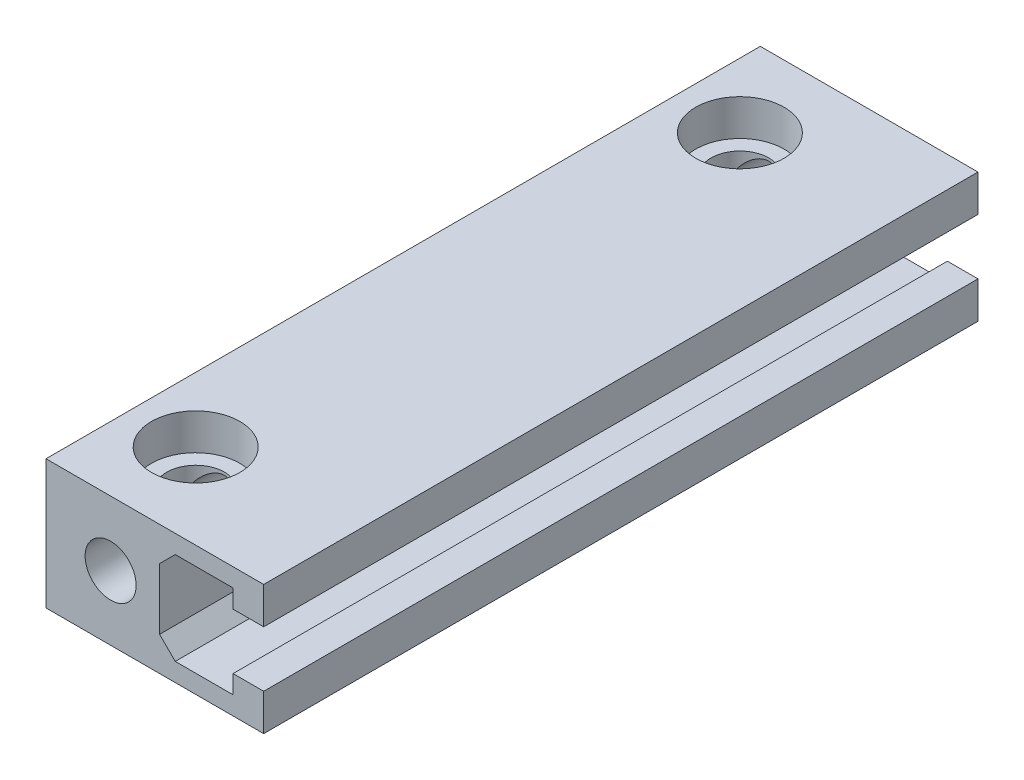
ISO-10303-21;
HEADER;
FILE_DESCRIPTION(('STEP AP214'),'2;1');
FILE_NAME('part.step','',(''),(''),'','','');
FILE_SCHEMA(('AUTOMOTIVE_DESIGN { 1 0 10303 214 1 1 1 1 }'));
ENDSEC;
DATA;
#1=APPLICATION_CONTEXT('core data for automotive mechanical design processes');
#2=APPLICATION_PROTOCOL_DEFINITION('international standard','automotive_design',2000,#1);
#3=PRODUCT_CONTEXT('',#1,'mechanical');
#4=PRODUCT('Part','Part','',(#3));
#5=PRODUCT_RELATED_PRODUCT_CATEGORY('part','',(#4));
#6=PRODUCT_DEFINITION_FORMATION('','',#4);
#7=PRODUCT_DEFINITION_CONTEXT('part definition',#1,'design');
#8=PRODUCT_DEFINITION('design','',#6,#7);
#9=PRODUCT_DEFINITION_SHAPE('','',#8);
#10=(LENGTH_UNIT() NAMED_UNIT(*) SI_UNIT(.MILLI.,.METRE.));
#11=(NAMED_UNIT(*) PLANE_ANGLE_UNIT() SI_UNIT($,.RADIAN.));
#12=(NAMED_UNIT(*) SI_UNIT($,.STERADIAN.) SOLID_ANGLE_UNIT());
#13=UNCERTAINTY_MEASURE_WITH_UNIT(LENGTH_MEASURE(1.E-05),#10,'distance_accuracy_value','');
#14=(GEOMETRIC_REPRESENTATION_CONTEXT(3) GLOBAL_UNCERTAINTY_ASSIGNED_CONTEXT((#13)) GLOBAL_UNIT_ASSIGNED_CONTEXT((#10,
#11,#12)) REPRESENTATION_CONTEXT('',''));
#15=CARTESIAN_POINT('',(0.,0.,0.));
#16=DIRECTION('',(0.,0.,1.));
#17=DIRECTION('',(1.,0.,0.));
#18=AXIS2_PLACEMENT_3D('',#15,#16,#17);
#19=CARTESIAN_POINT('',(0.,0.,-52.5));
#20=DIRECTION('',(0.,0.,1.));
#21=DIRECTION('',(1.,0.,0.));
#22=AXIS2_PLACEMENT_3D('',#19,#20,#21);
#23=CYLINDRICAL_SURFACE('',#22,3.75000000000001);
#24=CARTESIAN_POINT('',(3.75000000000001,0.,-42.));
#25=CARTESIAN_POINT('',(3.75000015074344,0.0591698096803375,-41.9999996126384));
#26=CARTESIAN_POINT('',(3.74859482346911,0.118337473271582,-42.0026421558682));
#27=CARTESIAN_POINT('',(3.74302523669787,0.236104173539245,-42.0130307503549));
#28=CARTESIAN_POINT('',(3.73885970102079,0.294702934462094,-42.0207791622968));
#29=CARTESIAN_POINT('',(3.72236852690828,0.469145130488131,-42.0511036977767));
#30=CARTESIAN_POINT('',(3.70604902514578,0.583407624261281,-42.0807564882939));
#31=CARTESIAN_POINT('',(3.65472003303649,0.855971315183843,-42.170051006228));
#32=CARTESIAN_POINT('',(3.61458785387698,1.01069707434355,-42.2371967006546));
#33=CARTESIAN_POINT('',(3.51808248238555,1.30771067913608,-42.3861153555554));
#34=CARTESIAN_POINT('',(3.46164565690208,1.44994688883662,-42.467945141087));
#35=CARTESIAN_POINT('',(3.34596758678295,1.69762921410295,-42.6219253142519));
#36=CARTESIAN_POINT('',(3.28925760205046,1.8049581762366,-42.692995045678));
#37=CARTESIAN_POINT('',(3.16622342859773,2.01299476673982,-42.836631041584));
#38=CARTESIAN_POINT('',(3.09989379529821,2.11369859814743,-42.9091981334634));
#39=CARTESIAN_POINT('',(2.95770972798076,2.30845467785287,-43.0536400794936));
#40=CARTESIAN_POINT('',(2.88186605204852,2.40251425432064,-43.1255156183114));
#41=CARTESIAN_POINT('',(2.72053727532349,2.58377464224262,-43.2669077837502));
#42=CARTESIAN_POINT('',(2.63505665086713,2.67097860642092,-43.3364254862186));
#43=CARTESIAN_POINT('',(2.40622885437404,2.88237279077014,-43.5074779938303));
#44=CARTESIAN_POINT('',(2.25624471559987,3.00163493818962,-43.606427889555));
#45=CARTESIAN_POINT('',(1.9335744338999,3.2189290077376,-43.7892070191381));
#46=CARTESIAN_POINT('',(1.76092761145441,3.31699693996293,-43.8730618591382));
#47=CARTESIAN_POINT('',(1.42941062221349,3.47073032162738,-44.0055910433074));
#48=CARTESIAN_POINT('',(1.2741430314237,3.53091075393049,-44.0579217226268));
#49=CARTESIAN_POINT('',(1.03305447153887,3.60588562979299,-44.1233804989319));
#50=CARTESIAN_POINT('',(0.951303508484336,3.62833202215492,-44.1430308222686));
#51=CARTESIAN_POINT('',(0.785539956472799,3.66778850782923,-44.1776286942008));
#52=CARTESIAN_POINT('',(0.701528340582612,3.68480090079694,-44.1925782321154));
#53=CARTESIAN_POINT('',(0.531302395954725,3.71318048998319,-44.2175423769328));
#54=CARTESIAN_POINT('',(0.44507787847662,3.72451321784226,-44.2275268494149));
#55=CARTESIAN_POINT('',(0.271637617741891,3.74116283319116,-44.2422027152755));
#56=CARTESIAN_POINT('',(0.184422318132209,3.74648231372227,-44.246896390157));
#57=CARTESIAN_POINT('',(0.00970159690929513,3.75100499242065,-44.2508866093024));
#58=CARTESIAN_POINT('',(-0.0778038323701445,3.7502080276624,-44.2501830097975));
#59=CARTESIAN_POINT('',(-0.252310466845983,3.74252342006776,-44.2434042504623));
#60=CARTESIAN_POINT('',(-0.339311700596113,3.73563612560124,-44.2373293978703));
#61=CARTESIAN_POINT('',(-0.583131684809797,3.70775897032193,-44.2127657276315));
#62=CARTESIAN_POINT('',(-0.738629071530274,3.67983325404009,-44.1881797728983));
#63=CARTESIAN_POINT('',(-1.04166886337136,3.60580599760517,-44.1232905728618));
#64=CARTESIAN_POINT('',(-1.18920915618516,3.55969965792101,-44.0829831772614));
#65=CARTESIAN_POINT('',(-1.48301745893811,3.44810318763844,-43.986050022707));
#66=CARTESIAN_POINT('',(-1.62858591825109,3.38155218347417,-43.9285374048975));
#67=CARTESIAN_POINT('',(-1.9060305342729,3.23331641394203,-43.8016945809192));
#68=CARTESIAN_POINT('',(-2.03790455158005,3.15162928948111,-43.7323625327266));
#69=CARTESIAN_POINT('',(-2.35229128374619,2.92969332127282,-43.5464956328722));
#70=CARTESIAN_POINT('',(-2.52554069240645,2.78106129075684,-43.4241445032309));
#71=CARTESIAN_POINT('',(-2.76083962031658,2.54026931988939,-43.2327420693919));
#72=CARTESIAN_POINT('',(-2.83535915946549,2.45675943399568,-43.1674250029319));
#73=CARTESIAN_POINT('',(-2.97621009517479,2.28409099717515,-43.035450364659));
#74=CARTESIAN_POINT('',(-3.04254479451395,2.19493474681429,-42.9687933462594));
#75=CARTESIAN_POINT('',(-3.1685543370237,2.00890337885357,-42.8339863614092));
#76=CARTESIAN_POINT('',(-3.22803486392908,1.91189568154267,-42.7658383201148));
#77=CARTESIAN_POINT('',(-3.33849556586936,1.71173207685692,-42.631446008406));
#78=CARTESIAN_POINT('',(-3.38946866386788,1.60857114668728,-42.5652033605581));
#79=CARTESIAN_POINT('',(-3.48230443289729,1.39621418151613,-42.4376692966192));
#80=CARTESIAN_POINT('',(-3.52421938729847,1.28705760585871,-42.3763508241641));
#81=CARTESIAN_POINT('',(-3.59858591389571,1.0614833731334,-42.2621451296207));
#82=CARTESIAN_POINT('',(-3.63105689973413,0.945081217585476,-42.2092407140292));
#83=CARTESIAN_POINT('',(-3.68129818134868,0.722193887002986,-42.1242935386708));
#84=CARTESIAN_POINT('',(-3.70053539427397,0.616802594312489,-42.0903195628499));
#85=CARTESIAN_POINT('',(-3.73004143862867,0.401297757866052,-42.0372133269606));
#86=CARTESIAN_POINT('',(-3.74033984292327,0.291201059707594,-42.018032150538));
#87=CARTESIAN_POINT('',(-3.75106485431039,0.0677640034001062,-41.9980425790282));
#88=CARTESIAN_POINT('',(-3.75140304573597,-0.045596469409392,-41.9973987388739));
#89=CARTESIAN_POINT('',(-3.74193333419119,-0.270489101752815,-42.0150705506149));
#90=CARTESIAN_POINT('',(-3.73210637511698,-0.382017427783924,-42.033421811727));
#91=CARTESIAN_POINT('',(-3.69935585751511,-0.630062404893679,-42.0925221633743));
#92=CARTESIAN_POINT('',(-3.67357161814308,-0.765005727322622,-42.1380464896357));
#93=CARTESIAN_POINT('',(-3.60952782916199,-1.02565428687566,-42.2444713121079));
#94=CARTESIAN_POINT('',(-3.57122251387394,-1.15132352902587,-42.3054280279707));
#95=CARTESIAN_POINT('',(-3.48843329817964,-1.38076370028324,-42.4286321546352));
#96=CARTESIAN_POINT('',(-3.44508081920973,-1.48542738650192,-42.490011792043));
#97=CARTESIAN_POINT('',(-3.35011888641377,-1.68872777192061,-42.6163823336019));
#98=CARTESIAN_POINT('',(-3.298503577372,-1.78736012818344,-42.6813757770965));
#99=CARTESIAN_POINT('',(-3.18714234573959,-1.97912324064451,-42.8128390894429));
#100=CARTESIAN_POINT('',(-3.12738476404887,-2.07224582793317,-42.8793109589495));
#101=CARTESIAN_POINT('',(-2.99981835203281,-2.25295728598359,-43.0119861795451));
#102=CARTESIAN_POINT('',(-2.93201163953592,-2.34054760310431,-43.0781895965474));
#103=CARTESIAN_POINT('',(-2.78449822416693,-2.51450629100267,-43.2124018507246));
#104=CARTESIAN_POINT('',(-2.70435528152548,-2.60057258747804,-43.2803247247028));
#105=CARTESIAN_POINT('',(-2.53491774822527,-2.76599224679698,-43.4129568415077));
#106=CARTESIAN_POINT('',(-2.44562102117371,-2.84534403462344,-43.4776653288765));
#107=CARTESIAN_POINT('',(-2.25809886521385,-2.996318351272,-43.6022371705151));
#108=CARTESIAN_POINT('',(-2.15990047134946,-3.06796292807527,-43.6621142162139));
#109=CARTESIAN_POINT('',(-1.95458178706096,-3.20268582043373,-43.7756970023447));
#110=CARTESIAN_POINT('',(-1.84746710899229,-3.26576945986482,-43.8294065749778));
#111=CARTESIAN_POINT('',(-1.59001040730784,-3.40020537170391,-43.9445969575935));
#112=CARTESIAN_POINT('',(-1.43654082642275,-3.46808631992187,-44.0033483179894));
#113=CARTESIAN_POINT('',(-1.19705533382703,-3.55482744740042,-44.0787988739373));
#114=CARTESIAN_POINT('',(-1.11566222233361,-3.58123166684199,-44.1018397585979));
#115=CARTESIAN_POINT('',(-0.950184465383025,-3.62864194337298,-44.1432968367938));
#116=CARTESIAN_POINT('',(-0.86610111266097,-3.64965055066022,-44.1617152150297));
#117=CARTESIAN_POINT('',(-0.695158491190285,-3.68604770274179,-44.1936704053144));
#118=CARTESIAN_POINT('',(-0.608283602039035,-3.70139472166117,-44.2071711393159));
#119=CARTESIAN_POINT('',(-0.433045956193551,-3.72596232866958,-44.2288014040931));
#120=CARTESIAN_POINT('',(-0.344683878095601,-3.73518563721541,-44.236933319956));
#121=CARTESIAN_POINT('',(-0.167192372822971,-3.74732615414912,-44.247639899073));
#122=CARTESIAN_POINT('',(-0.0780630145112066,-3.75024392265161,-44.2502150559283));
#123=CARTESIAN_POINT('',(0.100133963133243,-3.74972360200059,-44.2497562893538));
#124=CARTESIAN_POINT('',(0.189201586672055,-3.74628599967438,-44.2467227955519));
#125=CARTESIAN_POINT('',(0.437321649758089,-3.72783108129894,-44.2304472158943));
#126=CARTESIAN_POINT('',(0.595532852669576,-3.70576472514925,-44.21099261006));
#127=CARTESIAN_POINT('',(0.904951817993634,-3.64260555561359,-44.1555207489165));
#128=CARTESIAN_POINT('',(1.05615826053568,-3.60150917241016,-44.1195003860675));
#129=CARTESIAN_POINT('',(1.35414074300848,-3.5006378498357,-44.0316032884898));
#130=CARTESIAN_POINT('',(1.50053336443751,-3.44021567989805,-43.9791787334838));
#131=CARTESIAN_POINT('',(1.78054884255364,-3.30400403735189,-43.8620265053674));
#132=CARTESIAN_POINT('',(1.91416711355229,-3.22820907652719,-43.7972944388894));
#133=CARTESIAN_POINT('',(2.23133666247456,-3.02243224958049,-43.6236198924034));
#134=CARTESIAN_POINT('',(2.40644255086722,-2.88430756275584,-43.5087570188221));
#135=CARTESIAN_POINT('',(2.64580581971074,-2.65975014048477,-43.3275124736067));
#136=CARTESIAN_POINT('',(2.72185210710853,-2.58181229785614,-43.265459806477));
#137=CARTESIAN_POINT('',(2.86624012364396,-2.42050968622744,-43.1394777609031));
#138=CARTESIAN_POINT('',(2.93458471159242,-2.33714694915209,-43.075549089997));
#139=CARTESIAN_POINT('',(3.06506786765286,-2.16331692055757,-42.9455947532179));
#140=CARTESIAN_POINT('',(3.12703550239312,-2.07273318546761,-42.8795539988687));
#141=CARTESIAN_POINT('',(3.24306626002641,-1.88602969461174,-42.7482167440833));
#142=CARTESIAN_POINT('',(3.29712551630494,-1.78990726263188,-42.6829206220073));
#143=CARTESIAN_POINT('',(3.39705608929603,-1.59209402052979,-42.5552023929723));
#144=CARTESIAN_POINT('',(3.44294946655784,-1.49041921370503,-42.4927728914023));
#145=CARTESIAN_POINT('',(3.52632628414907,-1.28071693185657,-42.3733544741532));
#146=CARTESIAN_POINT('',(3.56381964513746,-1.17269714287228,-42.3163591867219));
#147=CARTESIAN_POINT('',(3.62883480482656,-0.952327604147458,-42.2130695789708));
#148=CARTESIAN_POINT('',(3.65658899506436,-0.840161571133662,-42.1665370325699));
#149=CARTESIAN_POINT('',(3.70205491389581,-0.609100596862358,-42.087914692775));
#150=CARTESIAN_POINT('',(3.71980788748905,-0.490235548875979,-42.0557656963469));
#151=CARTESIAN_POINT('',(3.73780132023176,-0.308344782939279,-42.0227434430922));
#152=CARTESIAN_POINT('',(3.74235988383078,-0.247091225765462,-42.0142692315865));
#153=CARTESIAN_POINT('',(3.74845930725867,-0.123891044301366,-42.0028974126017));
#154=CARTESIAN_POINT('',(3.74999984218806,-0.0619443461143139,-42.0000004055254));
#155=CARTESIAN_POINT('',(3.75000000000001,0.,-42.));
#156=B_SPLINE_CURVE_WITH_KNOTS('',3,(#24,#25,#26,#27,#28,#29,#30,#31,#32,#33,#34,#35,#36,#37,
#38,#39,#40,#41,#42,#43,#44,#45,#46,#47,#48,#49,#50,#51,#52,#53,#54,#55,#56,#57,#58,#59,#60,#61,
#62,#63,#64,#65,#66,#67,#68,#69,#70,#71,#72,#73,#74,#75,#76,#77,#78,#79,#80,#81,#82,#83,#84,#85,
#86,#87,#88,#89,#90,#91,#92,#93,#94,#95,#96,#97,#98,#99,#100,#101,#102,#103,#104,#105,#106,#107,
#108,#109,#110,#111,#112,#113,#114,#115,#116,#117,#118,#119,#120,#121,#122,#123,#124,#125,#126,
#127,#128,#129,#130,#131,#132,#133,#134,#135,#136,#137,#138,#139,#140,#141,#142,#143,#144,#145,
#146,#147,#148,#149,#150,#151,#152,#153,#154,#155),.UNSPECIFIED.,.T.,.F.,(4,2,2,2,2,2,2,2,2,2,2,
2,2,2,2,2,2,2,2,2,2,2,2,2,2,2,2,2,2,2,2,2,2,2,2,2,2,2,2,2,2,2,2,2,2,2,2,2,2,2,2,2,2,2,2,2,2,2,2,
2,2,2,2,2,2,4),(0.,0.177429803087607,0.354941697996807,0.710634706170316,1.22791760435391,
1.74724725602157,2.16874152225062,2.59047528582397,3.011736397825,3.43280263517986,
4.07730096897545,4.72069550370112,5.24199925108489,5.50279443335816,5.76347910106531,
6.02572719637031,6.28786216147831,6.5500041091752,6.8121310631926,7.28946118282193,
7.7669173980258,8.27525604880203,8.78367399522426,9.55609681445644,9.9445981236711,
10.3329421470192,10.7304589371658,11.128304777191,11.5237890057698,11.9184544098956,
12.2545180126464,12.5894655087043,12.927385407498,13.2659399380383,13.6976973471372,
14.1310508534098,14.5170838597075,14.9033916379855,15.2902585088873,15.6770238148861,
16.0839640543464,16.4909994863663,16.896837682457,17.3024223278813,17.8333727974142,
18.0989577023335,18.3644168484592,18.6317860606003,18.8990364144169,19.1662630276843,
19.4334691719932,19.9137965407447,20.3942140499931,20.8927882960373,21.3915408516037,
22.1397133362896,22.5154527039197,22.8910521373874,23.2749686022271,23.6590721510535,
24.0421217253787,24.4247164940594,24.7974363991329,25.1686077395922,25.3543374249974,
25.5400871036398),.UNSPECIFIED.);
#157=CARTESIAN_POINT('',(3.75000000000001,0.,-42.));
#158=VERTEX_POINT('',#157);
#159=EDGE_CURVE('E34',#158,#158,#156,.T.);
#160=ORIENTED_EDGE('',*,*,#159,.T.);
#161=EDGE_LOOP('',(#160));
#162=FACE_BOUND('',#161,.T.);
#163=CARTESIAN_POINT('',(0.,0.,-52.5));
#164=DIRECTION('',(0.,0.,1.));
#165=DIRECTION('',(1.,0.,0.));
#166=AXIS2_PLACEMENT_3D('',#163,#164,#165);
#167=CIRCLE('',#166,3.75000000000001);
#168=CARTESIAN_POINT('',(3.75000000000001,0.,-52.5));
#169=VERTEX_POINT('',#168);
#170=EDGE_CURVE('E195',#169,#169,#167,.T.);
#171=ORIENTED_EDGE('',*,*,#170,.F.);
#172=EDGE_LOOP('',(#171));
#173=FACE_BOUND('',#172,.T.);
#174=ADVANCED_FACE('F30',(#162,#173),#23,.F.);
#175=CARTESIAN_POINT('',(3.75000000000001,0.,-38.));
#176=CARTESIAN_POINT('',(3.75000015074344,-0.0591698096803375,-38.0000003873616));
#177=CARTESIAN_POINT('',(3.74859482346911,-0.118337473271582,-37.9973578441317));
#178=CARTESIAN_POINT('',(3.74302523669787,-0.236104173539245,-37.9869692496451));
#179=CARTESIAN_POINT('',(3.73885970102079,-0.294702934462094,-37.9792208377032));
#180=CARTESIAN_POINT('',(3.72236852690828,-0.469145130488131,-37.9488963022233));
#181=CARTESIAN_POINT('',(3.70604902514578,-0.583407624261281,-37.9192435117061));
#182=CARTESIAN_POINT('',(3.65472003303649,-0.855971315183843,-37.829948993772));
#183=CARTESIAN_POINT('',(3.61458785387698,-1.01069707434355,-37.7628032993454));
#184=CARTESIAN_POINT('',(3.51808248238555,-1.30771067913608,-37.6138846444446));
#185=CARTESIAN_POINT('',(3.46164565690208,-1.44994688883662,-37.532054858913));
#186=CARTESIAN_POINT('',(3.34596758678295,-1.69762921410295,-37.3780746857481));
#187=CARTESIAN_POINT('',(3.28925760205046,-1.8049581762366,-37.307004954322));
#188=CARTESIAN_POINT('',(3.16622342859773,-2.01299476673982,-37.163368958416));
#189=CARTESIAN_POINT('',(3.09989379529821,-2.11369859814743,-37.0908018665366));
#190=CARTESIAN_POINT('',(2.95770972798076,-2.30845467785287,-36.9463599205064));
#191=CARTESIAN_POINT('',(2.88186605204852,-2.40251425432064,-36.8744843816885));
#192=CARTESIAN_POINT('',(2.72053727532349,-2.58377464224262,-36.7330922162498));
#193=CARTESIAN_POINT('',(2.63505665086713,-2.67097860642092,-36.6635745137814));
#194=CARTESIAN_POINT('',(2.40622885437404,-2.88237279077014,-36.4925220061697));
#195=CARTESIAN_POINT('',(2.25624471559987,-3.00163493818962,-36.393572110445));
#196=CARTESIAN_POINT('',(1.9335744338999,-3.2189290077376,-36.2107929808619));
#197=CARTESIAN_POINT('',(1.76092761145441,-3.31699693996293,-36.1269381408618));
#198=CARTESIAN_POINT('',(1.42941062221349,-3.47073032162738,-35.9944089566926));
#199=CARTESIAN_POINT('',(1.2741430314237,-3.53091075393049,-35.9420782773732));
#200=CARTESIAN_POINT('',(1.03305447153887,-3.60588562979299,-35.8766195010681));
#201=CARTESIAN_POINT('',(0.951303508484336,-3.62833202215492,-35.8569691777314));
#202=CARTESIAN_POINT('',(0.7855399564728,-3.66778850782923,-35.8223713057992));
#203=CARTESIAN_POINT('',(0.701528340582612,-3.68480090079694,-35.8074217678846));
#204=CARTESIAN_POINT('',(0.531302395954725,-3.71318048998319,-35.7824576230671));
#205=CARTESIAN_POINT('',(0.44507787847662,-3.72451321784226,-35.7724731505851));
#206=CARTESIAN_POINT('',(0.271637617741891,-3.74116283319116,-35.7577972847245));
#207=CARTESIAN_POINT('',(0.184422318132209,-3.74648231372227,-35.753103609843));
#208=CARTESIAN_POINT('',(0.00970159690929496,-3.75100499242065,-35.7491133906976));
#209=CARTESIAN_POINT('',(-0.0778038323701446,-3.7502080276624,-35.7498169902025));
#210=CARTESIAN_POINT('',(-0.252310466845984,-3.74252342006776,-35.7565957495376));
#211=CARTESIAN_POINT('',(-0.339311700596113,-3.73563612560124,-35.7626706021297));
#212=CARTESIAN_POINT('',(-0.583131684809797,-3.70775897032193,-35.7872342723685));
#213=CARTESIAN_POINT('',(-0.738629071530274,-3.67983325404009,-35.8118202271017));
#214=CARTESIAN_POINT('',(-1.04166886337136,-3.60580599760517,-35.8767094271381));
#215=CARTESIAN_POINT('',(-1.18920915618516,-3.55969965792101,-35.9170168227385));
#216=CARTESIAN_POINT('',(-1.48301745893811,-3.44810318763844,-36.013949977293));
#217=CARTESIAN_POINT('',(-1.62858591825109,-3.38155218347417,-36.0714625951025));
#218=CARTESIAN_POINT('',(-1.9060305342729,-3.23331641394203,-36.1983054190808));
#219=CARTESIAN_POINT('',(-2.03790455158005,-3.15162928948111,-36.2676374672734));
#220=CARTESIAN_POINT('',(-2.35229128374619,-2.92969332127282,-36.4535043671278));
#221=CARTESIAN_POINT('',(-2.52554069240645,-2.78106129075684,-36.5758554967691));
#222=CARTESIAN_POINT('',(-2.76083962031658,-2.54026931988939,-36.7672579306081));
#223=CARTESIAN_POINT('',(-2.83535915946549,-2.45675943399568,-36.8325749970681));
#224=CARTESIAN_POINT('',(-2.97621009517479,-2.28409099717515,-36.964549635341));
#225=CARTESIAN_POINT('',(-3.04254479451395,-2.19493474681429,-37.0312066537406));
#226=CARTESIAN_POINT('',(-3.1685543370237,-2.00890337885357,-37.1660136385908));
#227=CARTESIAN_POINT('',(-3.22803486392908,-1.91189568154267,-37.2341616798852));
#228=CARTESIAN_POINT('',(-3.33849556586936,-1.71173207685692,-37.368553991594));
#229=CARTESIAN_POINT('',(-3.38946866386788,-1.60857114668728,-37.4347966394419));
#230=CARTESIAN_POINT('',(-3.48230443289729,-1.39621418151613,-37.5623307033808));
#231=CARTESIAN_POINT('',(-3.52421938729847,-1.28705760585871,-37.6236491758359));
#232=CARTESIAN_POINT('',(-3.59858591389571,-1.0614833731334,-37.7378548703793));
#233=CARTESIAN_POINT('',(-3.63105689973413,-0.945081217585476,-37.7907592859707));
#234=CARTESIAN_POINT('',(-3.68129818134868,-0.722193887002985,-37.8757064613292));
#235=CARTESIAN_POINT('',(-3.70053539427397,-0.616802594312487,-37.9096804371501));
#236=CARTESIAN_POINT('',(-3.73004143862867,-0.40129775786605,-37.9627866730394));
#237=CARTESIAN_POINT('',(-3.74033984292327,-0.291201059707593,-37.981967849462));
#238=CARTESIAN_POINT('',(-3.75106485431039,-0.0677640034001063,-38.0019574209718));
#239=CARTESIAN_POINT('',(-3.75140304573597,0.045596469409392,-38.002601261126));
#240=CARTESIAN_POINT('',(-3.74193333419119,0.270489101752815,-37.984929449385));
#241=CARTESIAN_POINT('',(-3.73210637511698,0.382017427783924,-37.966578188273));
#242=CARTESIAN_POINT('',(-3.69935585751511,0.630062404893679,-37.9074778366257));
#243=CARTESIAN_POINT('',(-3.67357161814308,0.765005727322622,-37.8619535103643));
#244=CARTESIAN_POINT('',(-3.60952782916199,1.02565428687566,-37.7555286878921));
#245=CARTESIAN_POINT('',(-3.57122251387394,1.15132352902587,-37.6945719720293));
#246=CARTESIAN_POINT('',(-3.48843329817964,1.38076370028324,-37.5713678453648));
#247=CARTESIAN_POINT('',(-3.44508081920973,1.48542738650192,-37.509988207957));
#248=CARTESIAN_POINT('',(-3.35011888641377,1.68872777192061,-37.3836176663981));
#249=CARTESIAN_POINT('',(-3.298503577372,1.78736012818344,-37.3186242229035));
#250=CARTESIAN_POINT('',(-3.18714234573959,1.97912324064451,-37.1871609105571));
#251=CARTESIAN_POINT('',(-3.12738476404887,2.07224582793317,-37.1206890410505));
#252=CARTESIAN_POINT('',(-2.99981835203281,2.25295728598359,-36.9880138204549));
#253=CARTESIAN_POINT('',(-2.93201163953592,2.34054760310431,-36.9218104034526));
#254=CARTESIAN_POINT('',(-2.78449822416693,2.51450629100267,-36.7875981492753));
#255=CARTESIAN_POINT('',(-2.70435528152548,2.60057258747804,-36.7196752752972));
#256=CARTESIAN_POINT('',(-2.53491774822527,2.76599224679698,-36.5870431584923));
#257=CARTESIAN_POINT('',(-2.44562102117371,2.84534403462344,-36.5223346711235));
#258=CARTESIAN_POINT('',(-2.25809886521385,2.996318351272,-36.3977628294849));
#259=CARTESIAN_POINT('',(-2.15990047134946,3.06796292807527,-36.3378857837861));
#260=CARTESIAN_POINT('',(-1.95458178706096,3.20268582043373,-36.2243029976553));
#261=CARTESIAN_POINT('',(-1.84746710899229,3.26576945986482,-36.1705934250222));
#262=CARTESIAN_POINT('',(-1.59001040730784,3.40020537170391,-36.0554030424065));
#263=CARTESIAN_POINT('',(-1.43654082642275,3.46808631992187,-35.9966516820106));
#264=CARTESIAN_POINT('',(-1.19705533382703,3.55482744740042,-35.9212011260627));
#265=CARTESIAN_POINT('',(-1.11566222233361,3.58123166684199,-35.8981602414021));
#266=CARTESIAN_POINT('',(-0.950184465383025,3.62864194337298,-35.8567031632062));
#267=CARTESIAN_POINT('',(-0.86610111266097,3.64965055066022,-35.8382847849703));
#268=CARTESIAN_POINT('',(-0.695158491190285,3.68604770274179,-35.8063295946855));
#269=CARTESIAN_POINT('',(-0.608283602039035,3.70139472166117,-35.7928288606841));
#270=CARTESIAN_POINT('',(-0.433045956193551,3.72596232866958,-35.7711985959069));
#271=CARTESIAN_POINT('',(-0.3446838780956,3.73518563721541,-35.763066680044));
#272=CARTESIAN_POINT('',(-0.16719237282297,3.74732615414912,-35.752360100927));
#273=CARTESIAN_POINT('',(-0.0780630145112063,3.75024392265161,-35.7497849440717));
#274=CARTESIAN_POINT('',(0.100133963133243,3.74972360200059,-35.7502437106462));
#275=CARTESIAN_POINT('',(0.189201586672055,3.74628599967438,-35.7532772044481));
#276=CARTESIAN_POINT('',(0.437321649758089,3.72783108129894,-35.7695527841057));
#277=CARTESIAN_POINT('',(0.595532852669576,3.70576472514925,-35.7890073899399));
#278=CARTESIAN_POINT('',(0.904951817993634,3.64260555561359,-35.8444792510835));
#279=CARTESIAN_POINT('',(1.05615826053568,3.60150917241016,-35.8804996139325));
#280=CARTESIAN_POINT('',(1.35414074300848,3.5006378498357,-35.9683967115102));
#281=CARTESIAN_POINT('',(1.50053336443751,3.44021567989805,-36.0208212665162));
#282=CARTESIAN_POINT('',(1.78054884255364,3.30400403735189,-36.1379734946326));
#283=CARTESIAN_POINT('',(1.91416711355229,3.22820907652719,-36.2027055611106));
#284=CARTESIAN_POINT('',(2.23133666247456,3.02243224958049,-36.3763801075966));
#285=CARTESIAN_POINT('',(2.40644255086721,2.88430756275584,-36.4912429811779));
#286=CARTESIAN_POINT('',(2.64580581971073,2.65975014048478,-36.6724875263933));
#287=CARTESIAN_POINT('',(2.72185210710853,2.58181229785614,-36.734540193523));
#288=CARTESIAN_POINT('',(2.86624012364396,2.42050968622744,-36.8605222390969));
#289=CARTESIAN_POINT('',(2.93458471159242,2.33714694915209,-36.924450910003));
#290=CARTESIAN_POINT('',(3.06506786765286,2.16331692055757,-37.0544052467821));
#291=CARTESIAN_POINT('',(3.12703550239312,2.07273318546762,-37.1204460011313));
#292=CARTESIAN_POINT('',(3.24306626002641,1.88602969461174,-37.2517832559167));
#293=CARTESIAN_POINT('',(3.29712551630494,1.78990726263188,-37.3170793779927));
#294=CARTESIAN_POINT('',(3.39705608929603,1.59209402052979,-37.4447976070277));
#295=CARTESIAN_POINT('',(3.44294946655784,1.49041921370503,-37.5072271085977));
#296=CARTESIAN_POINT('',(3.52632628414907,1.28071693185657,-37.6266455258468));
#297=CARTESIAN_POINT('',(3.56381964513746,1.17269714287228,-37.6836408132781));
#298=CARTESIAN_POINT('',(3.62883480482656,0.952327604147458,-37.7869304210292));
#299=CARTESIAN_POINT('',(3.65658899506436,0.840161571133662,-37.8334629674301));
#300=CARTESIAN_POINT('',(3.70205491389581,0.609100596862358,-37.912085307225));
#301=CARTESIAN_POINT('',(3.71980788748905,0.490235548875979,-37.9442343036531));
#302=CARTESIAN_POINT('',(3.73780132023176,0.308344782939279,-37.9772565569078));
#303=CARTESIAN_POINT('',(3.74235988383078,0.247091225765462,-37.9857307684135));
#304=CARTESIAN_POINT('',(3.74845930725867,0.123891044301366,-37.9971025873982));
#305=CARTESIAN_POINT('',(3.74999984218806,0.0619443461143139,-37.9999995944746));
#306=CARTESIAN_POINT('',(3.75000000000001,0.,-38.));
#307=B_SPLINE_CURVE_WITH_KNOTS('',3,(#175,#176,#177,#178,#179,#180,#181,#182,#183,#184,#185,
#186,#187,#188,#189,#190,#191,#192,#193,#194,#195,#196,#197,#198,#199,#200,#201,#202,#203,#204,
#205,#206,#207,#208,#209,#210,#211,#212,#213,#214,#215,#216,#217,#218,#219,#220,#221,#222,#223,
#224,#225,#226,#227,#228,#229,#230,#231,#232,#233,#234,#235,#236,#237,#238,#239,#240,#241,#242,
#243,#244,#245,#246,#247,#248,#249,#250,#251,#252,#253,#254,#255,#256,#257,#258,#259,#260,#261,
#262,#263,#264,#265,#266,#267,#268,#269,#270,#271,#272,#273,#274,#275,#276,#277,#278,#279,#280,
#281,#282,#283,#284,#285,#286,#287,#288,#289,#290,#291,#292,#293,#294,#295,#296,#297,#298,#299,
#300,#301,#302,#303,#304,#305,#306),.UNSPECIFIED.,.T.,.F.,(4,2,2,2,2,2,2,2,2,2,2,2,2,2,2,2,2,2,
2,2,2,2,2,2,2,2,2,2,2,2,2,2,2,2,2,2,2,2,2,2,2,2,2,2,2,2,2,2,2,2,2,2,2,2,2,2,2,2,2,2,2,2,2,2,2,
4),(0.,0.177429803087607,0.354941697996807,0.710634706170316,1.22791760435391,1.74724725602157,
2.16874152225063,2.59047528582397,3.011736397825,3.43280263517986,4.07730096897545,
4.72069550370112,5.24199925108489,5.50279443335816,5.76347910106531,6.02572719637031,
6.28786216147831,6.5500041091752,6.8121310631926,7.28946118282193,7.7669173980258,
8.27525604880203,8.78367399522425,9.55609681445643,9.9445981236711,10.3329421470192,
10.7304589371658,11.128304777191,11.5237890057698,11.9184544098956,12.2545180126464,
12.5894655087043,12.927385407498,13.2659399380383,13.6976973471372,14.1310508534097,
14.5170838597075,14.9033916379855,15.2902585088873,15.6770238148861,16.0839640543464,
16.4909994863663,16.896837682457,17.3024223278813,17.8333727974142,18.0989577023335,
18.3644168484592,18.6317860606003,18.8990364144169,19.1662630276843,19.4334691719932,
19.9137965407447,20.3942140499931,20.8927882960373,21.3915408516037,22.1397133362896,
22.5154527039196,22.8910521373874,23.2749686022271,23.6590721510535,24.0421217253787,
24.4247164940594,24.7974363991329,25.1686077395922,25.3543374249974,25.5400871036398),.UNSPECIFIED.);
#308=CARTESIAN_POINT('',(3.75000000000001,0.,-38.));
#309=VERTEX_POINT('',#308);
#310=EDGE_CURVE('E375',#309,#309,#307,.T.);
#311=ORIENTED_EDGE('',*,*,#310,.T.);
#312=EDGE_LOOP('',(#311));
#313=FACE_BOUND('',#312,.T.);
#314=CARTESIAN_POINT('',(3.75000000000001,0.,38.));
#315=CARTESIAN_POINT('',(3.75000015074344,0.0591698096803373,38.0000003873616));
#316=CARTESIAN_POINT('',(3.74859482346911,0.118337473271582,37.9973578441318));
#317=CARTESIAN_POINT('',(3.74302523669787,0.236104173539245,37.9869692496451));
#318=CARTESIAN_POINT('',(3.73885970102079,0.294702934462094,37.9792208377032));
#319=CARTESIAN_POINT('',(3.72236852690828,0.469145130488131,37.9488963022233));
#320=CARTESIAN_POINT('',(3.70604902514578,0.58340762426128,37.9192435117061));
#321=CARTESIAN_POINT('',(3.65472003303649,0.855971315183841,37.829948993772));
#322=CARTESIAN_POINT('',(3.61458785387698,1.01069707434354,37.7628032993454));
#323=CARTESIAN_POINT('',(3.51808248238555,1.30771067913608,37.6138846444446));
#324=CARTESIAN_POINT('',(3.46164565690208,1.44994688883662,37.532054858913));
#325=CARTESIAN_POINT('',(3.34596758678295,1.69762921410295,37.3780746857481));
#326=CARTESIAN_POINT('',(3.28925760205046,1.8049581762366,37.307004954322));
#327=CARTESIAN_POINT('',(3.16622342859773,2.01299476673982,37.163368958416));
#328=CARTESIAN_POINT('',(3.09989379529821,2.11369859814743,37.0908018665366));
#329=CARTESIAN_POINT('',(2.95770972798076,2.30845467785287,36.9463599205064));
#330=CARTESIAN_POINT('',(2.88186605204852,2.40251425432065,36.8744843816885));
#331=CARTESIAN_POINT('',(2.72053727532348,2.58377464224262,36.7330922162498));
#332=CARTESIAN_POINT('',(2.63505665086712,2.67097860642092,36.6635745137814));
#333=CARTESIAN_POINT('',(2.40622885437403,2.88237279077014,36.4925220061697));
#334=CARTESIAN_POINT('',(2.25624471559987,3.00163493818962,36.393572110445));
#335=CARTESIAN_POINT('',(1.9335744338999,3.2189290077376,36.2107929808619));
#336=CARTESIAN_POINT('',(1.76092761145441,3.31699693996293,36.1269381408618));
#337=CARTESIAN_POINT('',(1.42941062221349,3.47073032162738,35.9944089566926));
#338=CARTESIAN_POINT('',(1.2741430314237,3.5309107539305,35.9420782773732));
#339=CARTESIAN_POINT('',(1.03305447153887,3.60588562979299,35.8766195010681));
#340=CARTESIAN_POINT('',(0.951303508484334,3.62833202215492,35.8569691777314));
#341=CARTESIAN_POINT('',(0.785539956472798,3.66778850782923,35.8223713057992));
#342=CARTESIAN_POINT('',(0.70152834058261,3.68480090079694,35.8074217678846));
#343=CARTESIAN_POINT('',(0.531302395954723,3.71318048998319,35.7824576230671));
#344=CARTESIAN_POINT('',(0.445077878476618,3.72451321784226,35.7724731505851));
#345=CARTESIAN_POINT('',(0.271637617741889,3.74116283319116,35.7577972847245));
#346=CARTESIAN_POINT('',(0.184422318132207,3.74648231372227,35.753103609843));
#347=CARTESIAN_POINT('',(0.00970159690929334,3.75100499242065,35.7491133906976));
#348=CARTESIAN_POINT('',(-0.0778038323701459,3.7502080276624,35.7498169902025));
#349=CARTESIAN_POINT('',(-0.252310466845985,3.74252342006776,35.7565957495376));
#350=CARTESIAN_POINT('',(-0.339311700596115,3.73563612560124,35.7626706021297));
#351=CARTESIAN_POINT('',(-0.583131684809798,3.70775897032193,35.7872342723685));
#352=CARTESIAN_POINT('',(-0.738629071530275,3.67983325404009,35.8118202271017));
#353=CARTESIAN_POINT('',(-1.04166886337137,3.60580599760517,35.8767094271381));
#354=CARTESIAN_POINT('',(-1.18920915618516,3.55969965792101,35.9170168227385));
#355=CARTESIAN_POINT('',(-1.48301745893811,3.44810318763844,36.013949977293));
#356=CARTESIAN_POINT('',(-1.62858591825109,3.38155218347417,36.0714625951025));
#357=CARTESIAN_POINT('',(-1.9060305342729,3.23331641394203,36.1983054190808));
#358=CARTESIAN_POINT('',(-2.03790455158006,3.15162928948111,36.2676374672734));
#359=CARTESIAN_POINT('',(-2.35229128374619,2.92969332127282,36.4535043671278));
#360=CARTESIAN_POINT('',(-2.52554069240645,2.78106129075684,36.5758554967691));
#361=CARTESIAN_POINT('',(-2.76083962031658,2.54026931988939,36.7672579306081));
#362=CARTESIAN_POINT('',(-2.83535915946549,2.45675943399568,36.8325749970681));
#363=CARTESIAN_POINT('',(-2.9762100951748,2.28409099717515,36.964549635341));
#364=CARTESIAN_POINT('',(-3.04254479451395,2.19493474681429,37.0312066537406));
#365=CARTESIAN_POINT('',(-3.1685543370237,2.00890337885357,37.1660136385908));
#366=CARTESIAN_POINT('',(-3.22803486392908,1.91189568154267,37.2341616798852));
#367=CARTESIAN_POINT('',(-3.33849556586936,1.71173207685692,37.368553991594));
#368=CARTESIAN_POINT('',(-3.38946866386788,1.60857114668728,37.4347966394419));
#369=CARTESIAN_POINT('',(-3.48230443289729,1.39621418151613,37.5623307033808));
#370=CARTESIAN_POINT('',(-3.52421938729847,1.2870576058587,37.6236491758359));
#371=CARTESIAN_POINT('',(-3.59858591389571,1.0614833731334,37.7378548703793));
#372=CARTESIAN_POINT('',(-3.63105689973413,0.945081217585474,37.7907592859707));
#373=CARTESIAN_POINT('',(-3.68129818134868,0.722193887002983,37.8757064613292));
#374=CARTESIAN_POINT('',(-3.70053539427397,0.616802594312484,37.9096804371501));
#375=CARTESIAN_POINT('',(-3.73004143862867,0.401297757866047,37.9627866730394));
#376=CARTESIAN_POINT('',(-3.74033984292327,0.291201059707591,37.981967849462));
#377=CARTESIAN_POINT('',(-3.75106485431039,0.0677640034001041,38.0019574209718));
#378=CARTESIAN_POINT('',(-3.75140304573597,-0.0455964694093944,38.002601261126));
#379=CARTESIAN_POINT('',(-3.74193333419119,-0.270489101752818,37.984929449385));
#380=CARTESIAN_POINT('',(-3.73210637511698,-0.382017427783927,37.966578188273));
#381=CARTESIAN_POINT('',(-3.69935585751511,-0.630062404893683,37.9074778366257));
#382=CARTESIAN_POINT('',(-3.67357161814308,-0.765005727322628,37.8619535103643));
#383=CARTESIAN_POINT('',(-3.60952782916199,-1.02565428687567,37.7555286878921));
#384=CARTESIAN_POINT('',(-3.57122251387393,-1.15132352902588,37.6945719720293));
#385=CARTESIAN_POINT('',(-3.48843329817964,-1.38076370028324,37.5713678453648));
#386=CARTESIAN_POINT('',(-3.44508081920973,-1.48542738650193,37.509988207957));
#387=CARTESIAN_POINT('',(-3.35011888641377,-1.68872777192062,37.3836176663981));
#388=CARTESIAN_POINT('',(-3.298503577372,-1.78736012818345,37.3186242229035));
#389=CARTESIAN_POINT('',(-3.18714234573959,-1.97912324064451,37.1871609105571));
#390=CARTESIAN_POINT('',(-3.12738476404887,-2.07224582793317,37.1206890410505));
#391=CARTESIAN_POINT('',(-2.99981835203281,-2.2529572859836,36.9880138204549));
#392=CARTESIAN_POINT('',(-2.93201163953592,-2.34054760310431,36.9218104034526));
#393=CARTESIAN_POINT('',(-2.78449822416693,-2.51450629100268,36.7875981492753));
#394=CARTESIAN_POINT('',(-2.70435528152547,-2.60057258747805,36.7196752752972));
#395=CARTESIAN_POINT('',(-2.53491774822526,-2.76599224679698,36.5870431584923));
#396=CARTESIAN_POINT('',(-2.44562102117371,-2.84534403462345,36.5223346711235));
#397=CARTESIAN_POINT('',(-2.25809886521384,-2.99631835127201,36.3977628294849));
#398=CARTESIAN_POINT('',(-2.15990047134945,-3.06796292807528,36.3378857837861));
#399=CARTESIAN_POINT('',(-1.95458178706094,-3.20268582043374,36.2243029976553));
#400=CARTESIAN_POINT('',(-1.84746710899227,-3.26576945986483,36.1705934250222));
#401=CARTESIAN_POINT('',(-1.59001040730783,-3.40020537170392,36.0554030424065));
#402=CARTESIAN_POINT('',(-1.43654082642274,-3.46808631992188,35.9966516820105));
#403=CARTESIAN_POINT('',(-1.19705533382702,-3.55482744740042,35.9212011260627));
#404=CARTESIAN_POINT('',(-1.1156622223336,-3.58123166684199,35.8981602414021));
#405=CARTESIAN_POINT('',(-0.950184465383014,-3.62864194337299,35.8567031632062));
#406=CARTESIAN_POINT('',(-0.866101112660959,-3.64965055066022,35.8382847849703));
#407=CARTESIAN_POINT('',(-0.695158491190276,-3.68604770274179,35.8063295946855));
#408=CARTESIAN_POINT('',(-0.608283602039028,-3.70139472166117,35.7928288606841));
#409=CARTESIAN_POINT('',(-0.433045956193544,-3.72596232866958,35.7711985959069));
#410=CARTESIAN_POINT('',(-0.344683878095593,-3.73518563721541,35.763066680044));
#411=CARTESIAN_POINT('',(-0.167192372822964,-3.74732615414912,35.752360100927));
#412=CARTESIAN_POINT('',(-0.0780630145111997,-3.75024392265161,35.7497849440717));
#413=CARTESIAN_POINT('',(0.10013396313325,-3.74972360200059,35.7502437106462));
#414=CARTESIAN_POINT('',(0.189201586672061,-3.74628599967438,35.7532772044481));
#415=CARTESIAN_POINT('',(0.437321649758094,-3.72783108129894,35.7695527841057));
#416=CARTESIAN_POINT('',(0.59553285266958,-3.70576472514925,35.78900738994));
#417=CARTESIAN_POINT('',(0.904951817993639,-3.64260555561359,35.8444792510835));
#418=CARTESIAN_POINT('',(1.05615826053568,-3.60150917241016,35.8804996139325));
#419=CARTESIAN_POINT('',(1.35414074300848,-3.5006378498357,35.9683967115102));
#420=CARTESIAN_POINT('',(1.50053336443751,-3.44021567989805,36.0208212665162));
#421=CARTESIAN_POINT('',(1.78054884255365,-3.30400403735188,36.1379734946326));
#422=CARTESIAN_POINT('',(1.9141671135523,-3.22820907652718,36.2027055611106));
#423=CARTESIAN_POINT('',(2.23133666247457,-3.02243224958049,36.3763801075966));
#424=CARTESIAN_POINT('',(2.40644255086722,-2.88430756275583,36.4912429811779));
#425=CARTESIAN_POINT('',(2.64580581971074,-2.65975014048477,36.6724875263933));
#426=CARTESIAN_POINT('',(2.72185210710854,-2.58181229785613,36.734540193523));
#427=CARTESIAN_POINT('',(2.86624012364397,-2.42050968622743,36.8605222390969));
#428=CARTESIAN_POINT('',(2.93458471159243,-2.33714694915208,36.924450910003));
#429=CARTESIAN_POINT('',(3.06506786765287,-2.16331692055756,37.0544052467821));
#430=CARTESIAN_POINT('',(3.12703550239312,-2.0727331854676,37.1204460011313));
#431=CARTESIAN_POINT('',(3.24306626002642,-1.88602969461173,37.2517832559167));
#432=CARTESIAN_POINT('',(3.29712551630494,-1.78990726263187,37.3170793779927));
#433=CARTESIAN_POINT('',(3.39705608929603,-1.59209402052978,37.4447976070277));
#434=CARTESIAN_POINT('',(3.44294946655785,-1.49041921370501,37.5072271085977));
#435=CARTESIAN_POINT('',(3.52632628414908,-1.28071693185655,37.6266455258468));
#436=CARTESIAN_POINT('',(3.56381964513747,-1.17269714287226,37.6836408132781));
#437=CARTESIAN_POINT('',(3.62883480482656,-0.952327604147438,37.7869304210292));
#438=CARTESIAN_POINT('',(3.65658899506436,-0.840161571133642,37.8334629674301));
#439=CARTESIAN_POINT('',(3.70205491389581,-0.609100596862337,37.912085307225));
#440=CARTESIAN_POINT('',(3.71980788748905,-0.490235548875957,37.9442343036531));
#441=CARTESIAN_POINT('',(3.73780132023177,-0.30834478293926,37.9772565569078));
#442=CARTESIAN_POINT('',(3.74235988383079,-0.247091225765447,37.9857307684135));
#443=CARTESIAN_POINT('',(3.74845930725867,-0.123891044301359,37.9971025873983));
#444=CARTESIAN_POINT('',(3.74999984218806,-0.0619443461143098,37.9999995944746));
#445=CARTESIAN_POINT('',(3.75000000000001,0.,38.));
#446=B_SPLINE_CURVE_WITH_KNOTS('',3,(#314,#315,#316,#317,#318,#319,#320,#321,#322,#323,#324,
#325,#326,#327,#328,#329,#330,#331,#332,#333,#334,#335,#336,#337,#338,#339,#340,#341,#342,#343,
#344,#345,#346,#347,#348,#349,#350,#351,#352,#353,#354,#355,#356,#357,#358,#359,#360,#361,#362,
#363,#364,#365,#366,#367,#368,#369,#370,#371,#372,#373,#374,#375,#376,#377,#378,#379,#380,#381,
#382,#383,#384,#385,#386,#387,#388,#389,#390,#391,#392,#393,#394,#395,#396,#397,#398,#399,#400,
#401,#402,#403,#404,#405,#406,#407,#408,#409,#410,#411,#412,#413,#414,#415,#416,#417,#418,#419,
#420,#421,#422,#423,#424,#425,#426,#427,#428,#429,#430,#431,#432,#433,#434,#435,#436,#437,#438,
#439,#440,#441,#442,#443,#444,#445),.UNSPECIFIED.,.T.,.F.,(4,2,2,2,2,2,2,2,2,2,2,2,2,2,2,2,2,2,
2,2,2,2,2,2,2,2,2,2,2,2,2,2,2,2,2,2,2,2,2,2,2,2,2,2,2,2,2,2,2,2,2,2,2,2,2,2,2,2,2,2,2,2,2,2,2,
4),(0.,0.177429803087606,0.354941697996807,0.710634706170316,1.22791760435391,1.74724725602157,
2.16874152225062,2.59047528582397,3.011736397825,3.43280263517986,4.07730096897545,
4.72069550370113,5.24199925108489,5.50279443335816,5.76347910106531,6.02572719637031,
6.28786216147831,6.5500041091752,6.8121310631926,7.28946118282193,7.7669173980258,
8.27525604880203,8.78367399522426,9.55609681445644,9.9445981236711,10.3329421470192,
10.7304589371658,11.128304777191,11.5237890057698,11.9184544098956,12.2545180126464,
12.5894655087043,12.927385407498,13.2659399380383,13.6976973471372,14.1310508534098,
14.5170838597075,14.9033916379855,15.2902585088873,15.6770238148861,16.0839640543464,
16.4909994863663,16.896837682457,17.3024223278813,17.8333727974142,18.0989577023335,
18.3644168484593,18.6317860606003,18.8990364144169,19.1662630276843,19.4334691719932,
19.9137965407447,20.3942140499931,20.8927882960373,21.3915408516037,22.1397133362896,
22.5154527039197,22.8910521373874,23.2749686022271,23.6590721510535,24.0421217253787,
24.4247164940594,24.797436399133,25.1686077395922,25.3543374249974,25.5400871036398),.UNSPECIFIED.);
#447=CARTESIAN_POINT('',(3.75000000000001,0.,38.));
#448=VERTEX_POINT('',#447);
#449=EDGE_CURVE('E160',#448,#448,#446,.T.);
#450=ORIENTED_EDGE('',*,*,#449,.T.);
#451=EDGE_LOOP('',(#450));
#452=FACE_BOUND('',#451,.T.);
#453=ADVANCED_FACE('F283',(#313,#452),#23,.F.);
#454=CARTESIAN_POINT('',(-9.5,9.49999999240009,-52.5));
#455=DIRECTION('',(-1.,0.,0.));
#456=DIRECTION('',(0.,0.,1.));
#457=AXIS2_PLACEMENT_3D('',#454,#455,#456);
#458=PLANE('',#457);
#459=DIRECTION('',(0.,0.,1.));
#460=VECTOR('',#459,1.);
#461=CARTESIAN_POINT('',(-9.5,-9.50000000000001,-52.5));
#462=LINE('',#461,#460);
#463=CARTESIAN_POINT('',(-9.5,-9.50000000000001,-52.5));
#464=VERTEX_POINT('',#463);
#465=CARTESIAN_POINT('',(-9.5,-9.50000000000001,52.5));
#466=VERTEX_POINT('',#465);
#467=EDGE_CURVE('E133',#464,#466,#462,.T.);
#468=ORIENTED_EDGE('',*,*,#467,.T.);
#469=DIRECTION('',(0.,-1.,0.));
#470=VECTOR('',#469,1.);
#471=CARTESIAN_POINT('',(-9.5,9.49999999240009,52.5));
#472=LINE('',#471,#470);
#473=CARTESIAN_POINT('',(-9.5,9.49999999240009,52.5));
#474=VERTEX_POINT('',#473);
#475=EDGE_CURVE('E136',#474,#466,#472,.T.);
#476=ORIENTED_EDGE('',*,*,#475,.F.);
#477=DIRECTION('',(0.,0.,1.));
#478=VECTOR('',#477,1.);
#479=CARTESIAN_POINT('',(-9.5,9.49999999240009,-52.5));
#480=LINE('',#479,#478);
#481=CARTESIAN_POINT('',(-9.5,9.49999999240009,-52.5));
#482=VERTEX_POINT('',#481);
#483=EDGE_CURVE('E11',#482,#474,#480,.T.);
#484=ORIENTED_EDGE('',*,*,#483,.F.);
#485=DIRECTION('',(0.,-1.,0.));
#486=VECTOR('',#485,1.);
#487=CARTESIAN_POINT('',(-9.5,9.49999999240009,-52.5));
#488=LINE('',#487,#486);
#489=EDGE_CURVE('E137',#482,#464,#488,.T.);
#490=ORIENTED_EDGE('',*,*,#489,.T.);
#491=EDGE_LOOP('',(#468,#476,#484,#490));
#492=FACE_BOUND('',#491,.T.);
#493=ADVANCED_FACE('F32',(#492),#458,.T.);
#494=CARTESIAN_POINT('',(22.4999999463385,9.49999999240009,-52.5));
#495=DIRECTION('',(0.,1.,0.));
#496=DIRECTION('',(0.,0.,1.));
#497=AXIS2_PLACEMENT_3D('',#494,#495,#496);
#498=PLANE('',#497);
#499=CARTESIAN_POINT('',(0.,9.49999999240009,-40.));
#500=DIRECTION('',(0.,1.,0.));
#501=DIRECTION('',(0.,0.,1.));
#502=AXIS2_PLACEMENT_3D('',#499,#500,#501);
#503=CIRCLE('',#502,6.5);
#504=CARTESIAN_POINT('',(0.,9.49999999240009,-33.5));
#505=VERTEX_POINT('',#504);
#506=EDGE_CURVE('E382',#505,#505,#503,.T.);
#507=ORIENTED_EDGE('',*,*,#506,.F.);
#508=EDGE_LOOP('',(#507));
#509=FACE_BOUND('',#508,.T.);
#510=CARTESIAN_POINT('',(0.,9.49999999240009,40.));
#511=DIRECTION('',(0.,1.,0.));
#512=DIRECTION('',(0.,0.,1.));
#513=AXIS2_PLACEMENT_3D('',#510,#511,#512);
#514=CIRCLE('',#513,6.5);
#515=CARTESIAN_POINT('',(0.,9.49999999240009,46.5));
#516=VERTEX_POINT('',#515);
#517=EDGE_CURVE('E371',#516,#516,#514,.T.);
#518=ORIENTED_EDGE('',*,*,#517,.F.);
#519=EDGE_LOOP('',(#518));
#520=FACE_BOUND('',#519,.T.);
#521=ORIENTED_EDGE('',*,*,#483,.T.);
#522=DIRECTION('',(-1.,0.,0.));
#523=VECTOR('',#522,1.);
#524=CARTESIAN_POINT('',(22.4999999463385,9.49999999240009,52.5));
#525=LINE('',#524,#523);
#526=CARTESIAN_POINT('',(22.4999999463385,9.49999999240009,52.5));
#527=VERTEX_POINT('',#526);
#528=EDGE_CURVE('E156',#527,#474,#525,.T.);
#529=ORIENTED_EDGE('',*,*,#528,.F.);
#530=DIRECTION('',(0.,0.,1.));
#531=VECTOR('',#530,1.);
#532=CARTESIAN_POINT('',(22.4999999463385,9.49999999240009,-52.5));
#533=LINE('',#532,#531);
#534=CARTESIAN_POINT('',(22.4999999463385,9.49999999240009,-52.5));
#535=VERTEX_POINT('',#534);
#536=EDGE_CURVE('E43',#535,#527,#533,.T.);
#537=ORIENTED_EDGE('',*,*,#536,.F.);
#538=DIRECTION('',(-1.,0.,0.));
#539=VECTOR('',#538,1.);
#540=CARTESIAN_POINT('',(22.4999999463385,9.49999999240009,-52.5));
#541=LINE('',#540,#539);
#542=EDGE_CURVE('E142',#535,#482,#541,.T.);
#543=ORIENTED_EDGE('',*,*,#542,.T.);
#544=EDGE_LOOP('',(#521,#529,#537,#543));
#545=FACE_BOUND('',#544,.T.);
#546=ADVANCED_FACE('F300',(#509,#520,#545),#498,.T.);
#547=CARTESIAN_POINT('',(22.4999999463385,4.10000000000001,-52.5));
#548=DIRECTION('',(1.,0.,0.));
#549=DIRECTION('',(0.,0.,-1.));
#550=AXIS2_PLACEMENT_3D('',#547,#548,#549);
#551=PLANE('',#550);
#552=ORIENTED_EDGE('',*,*,#536,.T.);
#553=DIRECTION('',(0.,1.,0.));
#554=VECTOR('',#553,1.);
#555=CARTESIAN_POINT('',(22.4999999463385,4.10000000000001,52.5));
#556=LINE('',#555,#554);
#557=CARTESIAN_POINT('',(22.4999999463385,4.10000000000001,52.5));
#558=VERTEX_POINT('',#557);
#559=EDGE_CURVE('E192',#558,#527,#556,.T.);
#560=ORIENTED_EDGE('',*,*,#559,.F.);
#561=DIRECTION('',(0.,0.,1.));
#562=VECTOR('',#561,1.);
#563=CARTESIAN_POINT('',(22.4999999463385,4.10000000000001,-52.5));
#564=LINE('',#563,#562);
#565=CARTESIAN_POINT('',(22.4999999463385,4.10000000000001,-52.5));
#566=VERTEX_POINT('',#565);
#567=EDGE_CURVE('E235',#566,#558,#564,.T.);
#568=ORIENTED_EDGE('',*,*,#567,.F.);
#569=DIRECTION('',(0.,1.,0.));
#570=VECTOR('',#569,1.);
#571=CARTESIAN_POINT('',(22.4999999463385,4.10000000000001,-52.5));
#572=LINE('',#571,#570);
#573=EDGE_CURVE('E231',#566,#535,#572,.T.);
#574=ORIENTED_EDGE('',*,*,#573,.T.);
#575=EDGE_LOOP('',(#552,#560,#568,#574));
#576=FACE_BOUND('',#575,.T.);
#577=ADVANCED_FACE('F302',(#576),#551,.T.);
#578=CARTESIAN_POINT('',(17.9999999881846,4.10000000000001,-52.5));
#579=DIRECTION('',(0.,-1.,0.));
#580=DIRECTION('',(0.,0.,-1.));
#581=AXIS2_PLACEMENT_3D('',#578,#579,#580);
#582=PLANE('',#581);
#583=ORIENTED_EDGE('',*,*,#567,.T.);
#584=DIRECTION('',(1.,0.,0.));
#585=VECTOR('',#584,1.);
#586=CARTESIAN_POINT('',(17.9999999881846,4.10000000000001,52.5));
#587=LINE('',#586,#585);
#588=CARTESIAN_POINT('',(17.9999999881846,4.10000000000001,52.5));
#589=VERTEX_POINT('',#588);
#590=EDGE_CURVE('E189',#589,#558,#587,.T.);
#591=ORIENTED_EDGE('',*,*,#590,.F.);
#592=DIRECTION('',(0.,0.,1.));
#593=VECTOR('',#592,1.);
#594=CARTESIAN_POINT('',(17.9999999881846,4.10000000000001,-52.5));
#595=LINE('',#594,#593);
#596=CARTESIAN_POINT('',(17.9999999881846,4.10000000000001,-52.5));
#597=VERTEX_POINT('',#596);
#598=EDGE_CURVE('E237',#597,#589,#595,.T.);
#599=ORIENTED_EDGE('',*,*,#598,.F.);
#600=DIRECTION('',(1.,0.,0.));
#601=VECTOR('',#600,1.);
#602=CARTESIAN_POINT('',(17.9999999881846,4.10000000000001,-52.5));
#603=LINE('',#602,#601);
#604=EDGE_CURVE('E228',#597,#566,#603,.T.);
#605=ORIENTED_EDGE('',*,*,#604,.T.);
#606=EDGE_LOOP('',(#583,#591,#599,#605));
#607=FACE_BOUND('',#606,.T.);
#608=ADVANCED_FACE('F309',(#607),#582,.T.);
#609=CARTESIAN_POINT('',(17.9999999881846,6.80000000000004,-52.5));
#610=DIRECTION('',(-1.,0.,0.));
#611=DIRECTION('',(0.,0.,1.));
#612=AXIS2_PLACEMENT_3D('',#609,#610,#611);
#613=PLANE('',#612);
#614=ORIENTED_EDGE('',*,*,#598,.T.);
#615=DIRECTION('',(0.,-1.,0.));
#616=VECTOR('',#615,1.);
#617=CARTESIAN_POINT('',(17.9999999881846,6.80000000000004,52.5));
#618=LINE('',#617,#616);
#619=CARTESIAN_POINT('',(17.9999999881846,6.80000000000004,52.5));
#620=VERTEX_POINT('',#619);
#621=EDGE_CURVE('E186',#620,#589,#618,.T.);
#622=ORIENTED_EDGE('',*,*,#621,.F.);
#623=DIRECTION('',(0.,0.,1.));
#624=VECTOR('',#623,1.);
#625=CARTESIAN_POINT('',(17.9999999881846,6.80000000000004,-52.5));
#626=LINE('',#625,#624);
#627=CARTESIAN_POINT('',(17.9999999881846,6.80000000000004,-52.5));
#628=VERTEX_POINT('',#627);
#629=EDGE_CURVE('E239',#628,#620,#626,.T.);
#630=ORIENTED_EDGE('',*,*,#629,.F.);
#631=DIRECTION('',(0.,-1.,0.));
#632=VECTOR('',#631,1.);
#633=CARTESIAN_POINT('',(17.9999999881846,6.80000000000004,-52.5));
#634=LINE('',#633,#632);
#635=EDGE_CURVE('E225',#628,#597,#634,.T.);
#636=ORIENTED_EDGE('',*,*,#635,.T.);
#637=EDGE_LOOP('',(#614,#622,#630,#636));
#638=FACE_BOUND('',#637,.T.);
#639=ADVANCED_FACE('F317',(#638),#613,.T.);
#640=CARTESIAN_POINT('',(9.4999999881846,6.80000000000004,-52.5));
#641=DIRECTION('',(0.,-1.,0.));
#642=DIRECTION('',(0.,0.,-1.));
#643=AXIS2_PLACEMENT_3D('',#640,#641,#642);
#644=PLANE('',#643);
#645=ORIENTED_EDGE('',*,*,#629,.T.);
#646=DIRECTION('',(1.,0.,0.));
#647=VECTOR('',#646,1.);
#648=CARTESIAN_POINT('',(9.4999999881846,6.80000000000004,52.5));
#649=LINE('',#648,#647);
#650=CARTESIAN_POINT('',(9.4999999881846,6.80000000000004,52.5));
#651=VERTEX_POINT('',#650);
#652=EDGE_CURVE('E183',#651,#620,#649,.T.);
#653=ORIENTED_EDGE('',*,*,#652,.F.);
#654=DIRECTION('',(0.,0.,1.));
#655=VECTOR('',#654,1.);
#656=CARTESIAN_POINT('',(9.4999999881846,6.80000000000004,-52.5));
#657=LINE('',#656,#655);
#658=CARTESIAN_POINT('',(9.4999999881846,6.80000000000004,-52.5));
#659=VERTEX_POINT('',#658);
#660=EDGE_CURVE('E241',#659,#651,#657,.T.);
#661=ORIENTED_EDGE('',*,*,#660,.F.);
#662=DIRECTION('',(1.,0.,0.));
#663=VECTOR('',#662,1.);
#664=CARTESIAN_POINT('',(9.4999999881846,6.80000000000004,-52.5));
#665=LINE('',#664,#663);
#666=EDGE_CURVE('E222',#659,#628,#665,.T.);
#667=ORIENTED_EDGE('',*,*,#666,.T.);
#668=EDGE_LOOP('',(#645,#653,#661,#667));
#669=FACE_BOUND('',#668,.T.);
#670=ADVANCED_FACE('F321',(#669),#644,.T.);
#671=CARTESIAN_POINT('',(7.1999999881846,4.50000000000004,-52.5));
#672=DIRECTION('',(0.707106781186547,-0.707106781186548,0.));
#673=DIRECTION('',(0.707106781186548,0.707106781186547,0.));
#674=AXIS2_PLACEMENT_3D('',#671,#672,#673);
#675=PLANE('',#674);
#676=ORIENTED_EDGE('',*,*,#660,.T.);
#677=DIRECTION('',(0.707106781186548,0.707106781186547,0.));
#678=VECTOR('',#677,1.);
#679=CARTESIAN_POINT('',(7.1999999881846,4.50000000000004,52.5));
#680=LINE('',#679,#678);
#681=CARTESIAN_POINT('',(7.1999999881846,4.50000000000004,52.5));
#682=VERTEX_POINT('',#681);
#683=EDGE_CURVE('E180',#682,#651,#680,.T.);
#684=ORIENTED_EDGE('',*,*,#683,.F.);
#685=DIRECTION('',(0.,0.,1.));
#686=VECTOR('',#685,1.);
#687=CARTESIAN_POINT('',(7.1999999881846,4.50000000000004,-52.5));
#688=LINE('',#687,#686);
#689=CARTESIAN_POINT('',(7.1999999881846,4.50000000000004,-52.5));
#690=VERTEX_POINT('',#689);
#691=EDGE_CURVE('E243',#690,#682,#688,.T.);
#692=ORIENTED_EDGE('',*,*,#691,.F.);
#693=DIRECTION('',(0.707106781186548,0.707106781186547,0.));
#694=VECTOR('',#693,1.);
#695=CARTESIAN_POINT('',(7.1999999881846,4.50000000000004,-52.5));
#696=LINE('',#695,#694);
#697=EDGE_CURVE('E219',#690,#659,#696,.T.);
#698=ORIENTED_EDGE('',*,*,#697,.T.);
#699=EDGE_LOOP('',(#676,#684,#692,#698));
#700=FACE_BOUND('',#699,.T.);
#701=ADVANCED_FACE('F325',(#700),#675,.T.);
#702=CARTESIAN_POINT('',(7.1999999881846,-4.49999999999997,-52.5));
#703=DIRECTION('',(1.,0.,0.));
#704=DIRECTION('',(0.,0.,-1.));
#705=AXIS2_PLACEMENT_3D('',#702,#703,#704);
#706=PLANE('',#705);
#707=ORIENTED_EDGE('',*,*,#691,.T.);
#708=DIRECTION('',(0.,1.,0.));
#709=VECTOR('',#708,1.);
#710=CARTESIAN_POINT('',(7.1999999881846,-4.49999999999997,52.5));
#711=LINE('',#710,#709);
#712=CARTESIAN_POINT('',(7.1999999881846,-4.49999999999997,52.5));
#713=VERTEX_POINT('',#712);
#714=EDGE_CURVE('E177',#713,#682,#711,.T.);
#715=ORIENTED_EDGE('',*,*,#714,.F.);
#716=DIRECTION('',(0.,0.,1.));
#717=VECTOR('',#716,1.);
#718=CARTESIAN_POINT('',(7.1999999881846,-4.49999999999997,-52.5));
#719=LINE('',#718,#717);
#720=CARTESIAN_POINT('',(7.1999999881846,-4.49999999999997,-52.5));
#721=VERTEX_POINT('',#720);
#722=EDGE_CURVE('E245',#721,#713,#719,.T.);
#723=ORIENTED_EDGE('',*,*,#722,.F.);
#724=DIRECTION('',(0.,1.,0.));
#725=VECTOR('',#724,1.);
#726=CARTESIAN_POINT('',(7.1999999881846,-4.49999999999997,-52.5));
#727=LINE('',#726,#725);
#728=EDGE_CURVE('E216',#721,#690,#727,.T.);
#729=ORIENTED_EDGE('',*,*,#728,.T.);
#730=EDGE_LOOP('',(#707,#715,#723,#729));
#731=FACE_BOUND('',#730,.T.);
#732=ADVANCED_FACE('F329',(#731),#706,.T.);
#733=CARTESIAN_POINT('',(9.4999999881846,-6.79999999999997,-52.5));
#734=DIRECTION('',(0.707106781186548,0.707106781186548,0.));
#735=DIRECTION('',(-0.707106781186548,0.707106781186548,0.));
#736=AXIS2_PLACEMENT_3D('',#733,#734,#735);
#737=PLANE('',#736);
#738=ORIENTED_EDGE('',*,*,#722,.T.);
#739=DIRECTION('',(-0.707106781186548,0.707106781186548,0.));
#740=VECTOR('',#739,1.);
#741=CARTESIAN_POINT('',(9.4999999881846,-6.79999999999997,52.5));
#742=LINE('',#741,#740);
#743=CARTESIAN_POINT('',(9.4999999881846,-6.79999999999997,52.5));
#744=VERTEX_POINT('',#743);
#745=EDGE_CURVE('E174',#744,#713,#742,.T.);
#746=ORIENTED_EDGE('',*,*,#745,.F.);
#747=DIRECTION('',(0.,0.,1.));
#748=VECTOR('',#747,1.);
#749=CARTESIAN_POINT('',(9.4999999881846,-6.79999999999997,-52.5));
#750=LINE('',#749,#748);
#751=CARTESIAN_POINT('',(9.4999999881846,-6.79999999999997,-52.5));
#752=VERTEX_POINT('',#751);
#753=EDGE_CURVE('E247',#752,#744,#750,.T.);
#754=ORIENTED_EDGE('',*,*,#753,.F.);
#755=DIRECTION('',(-0.707106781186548,0.707106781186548,0.));
#756=VECTOR('',#755,1.);
#757=CARTESIAN_POINT('',(9.4999999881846,-6.79999999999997,-52.5));
#758=LINE('',#757,#756);
#759=EDGE_CURVE('E213',#752,#721,#758,.T.);
#760=ORIENTED_EDGE('',*,*,#759,.T.);
#761=EDGE_LOOP('',(#738,#746,#754,#760));
#762=FACE_BOUND('',#761,.T.);
#763=ADVANCED_FACE('F333',(#762),#737,.T.);
#764=CARTESIAN_POINT('',(17.9999999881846,-6.79999999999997,-52.5));
#765=DIRECTION('',(0.,1.,0.));
#766=DIRECTION('',(0.,0.,1.));
#767=AXIS2_PLACEMENT_3D('',#764,#765,#766);
#768=PLANE('',#767);
#769=ORIENTED_EDGE('',*,*,#753,.T.);
#770=DIRECTION('',(-1.,0.,0.));
#771=VECTOR('',#770,1.);
#772=CARTESIAN_POINT('',(17.9999999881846,-6.79999999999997,52.5));
#773=LINE('',#772,#771);
#774=CARTESIAN_POINT('',(17.9999999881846,-6.79999999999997,52.5));
#775=VERTEX_POINT('',#774);
#776=EDGE_CURVE('E171',#775,#744,#773,.T.);
#777=ORIENTED_EDGE('',*,*,#776,.F.);
#778=DIRECTION('',(0.,0.,1.));
#779=VECTOR('',#778,1.);
#780=CARTESIAN_POINT('',(17.9999999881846,-6.79999999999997,-52.5));
#781=LINE('',#780,#779);
#782=CARTESIAN_POINT('',(17.9999999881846,-6.79999999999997,-52.5));
#783=VERTEX_POINT('',#782);
#784=EDGE_CURVE('E249',#783,#775,#781,.T.);
#785=ORIENTED_EDGE('',*,*,#784,.F.);
#786=DIRECTION('',(-1.,0.,0.));
#787=VECTOR('',#786,1.);
#788=CARTESIAN_POINT('',(17.9999999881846,-6.79999999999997,-52.5));
#789=LINE('',#788,#787);
#790=EDGE_CURVE('E210',#783,#752,#789,.T.);
#791=ORIENTED_EDGE('',*,*,#790,.T.);
#792=EDGE_LOOP('',(#769,#777,#785,#791));
#793=FACE_BOUND('',#792,.T.);
#794=ADVANCED_FACE('F337',(#793),#768,.T.);
#795=CARTESIAN_POINT('',(17.9999999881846,-4.10000000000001,-52.5));
#796=DIRECTION('',(-1.,0.,0.));
#797=DIRECTION('',(0.,0.,1.));
#798=AXIS2_PLACEMENT_3D('',#795,#796,#797);
#799=PLANE('',#798);
#800=ORIENTED_EDGE('',*,*,#784,.T.);
#801=DIRECTION('',(0.,-1.,0.));
#802=VECTOR('',#801,1.);
#803=CARTESIAN_POINT('',(17.9999999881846,-4.10000000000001,52.5));
#804=LINE('',#803,#802);
#805=CARTESIAN_POINT('',(17.9999999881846,-4.10000000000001,52.5));
#806=VERTEX_POINT('',#805);
#807=EDGE_CURVE('E168',#806,#775,#804,.T.);
#808=ORIENTED_EDGE('',*,*,#807,.F.);
#809=DIRECTION('',(0.,0.,1.));
#810=VECTOR('',#809,1.);
#811=CARTESIAN_POINT('',(17.9999999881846,-4.10000000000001,-52.5));
#812=LINE('',#811,#810);
#813=CARTESIAN_POINT('',(17.9999999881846,-4.10000000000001,-52.5));
#814=VERTEX_POINT('',#813);
#815=EDGE_CURVE('E251',#814,#806,#812,.T.);
#816=ORIENTED_EDGE('',*,*,#815,.F.);
#817=DIRECTION('',(0.,-1.,0.));
#818=VECTOR('',#817,1.);
#819=CARTESIAN_POINT('',(17.9999999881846,-4.10000000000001,-52.5));
#820=LINE('',#819,#818);
#821=EDGE_CURVE('E207',#814,#783,#820,.T.);
#822=ORIENTED_EDGE('',*,*,#821,.T.);
#823=EDGE_LOOP('',(#800,#808,#816,#822));
#824=FACE_BOUND('',#823,.T.);
#825=ADVANCED_FACE('F341',(#824),#799,.T.);
#826=CARTESIAN_POINT('',(22.4999999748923,-4.10000000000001,-52.5));
#827=DIRECTION('',(0.,1.,0.));
#828=DIRECTION('',(0.,0.,1.));
#829=AXIS2_PLACEMENT_3D('',#826,#827,#828);
#830=PLANE('',#829);
#831=ORIENTED_EDGE('',*,*,#815,.T.);
#832=DIRECTION('',(-1.,0.,0.));
#833=VECTOR('',#832,1.);
#834=CARTESIAN_POINT('',(22.4999999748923,-4.10000000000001,52.5));
#835=LINE('',#834,#833);
#836=CARTESIAN_POINT('',(22.4999999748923,-4.10000000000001,52.5));
#837=VERTEX_POINT('',#836);
#838=EDGE_CURVE('E165',#837,#806,#835,.T.);
#839=ORIENTED_EDGE('',*,*,#838,.F.);
#840=DIRECTION('',(0.,0.,1.));
#841=VECTOR('',#840,1.);
#842=CARTESIAN_POINT('',(22.4999999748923,-4.10000000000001,-52.5));
#843=LINE('',#842,#841);
#844=CARTESIAN_POINT('',(22.4999999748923,-4.10000000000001,-52.5));
#845=VERTEX_POINT('',#844);
#846=EDGE_CURVE('E253',#845,#837,#843,.T.);
#847=ORIENTED_EDGE('',*,*,#846,.F.);
#848=DIRECTION('',(-1.,0.,0.));
#849=VECTOR('',#848,1.);
#850=CARTESIAN_POINT('',(22.4999999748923,-4.10000000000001,-52.5));
#851=LINE('',#850,#849);
#852=EDGE_CURVE('E204',#845,#814,#851,.T.);
#853=ORIENTED_EDGE('',*,*,#852,.T.);
#854=EDGE_LOOP('',(#831,#839,#847,#853));
#855=FACE_BOUND('',#854,.T.);
#856=ADVANCED_FACE('F345',(#855),#830,.T.);
#857=CARTESIAN_POINT('',(22.4999999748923,-9.5,-52.5));
#858=DIRECTION('',(1.,0.,0.));
#859=DIRECTION('',(0.,0.,-1.));
#860=AXIS2_PLACEMENT_3D('',#857,#858,#859);
#861=PLANE('',#860);
#862=ORIENTED_EDGE('',*,*,#846,.T.);
#863=DIRECTION('',(0.,1.,0.));
#864=VECTOR('',#863,1.);
#865=CARTESIAN_POINT('',(22.4999999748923,-9.5,52.5));
#866=LINE('',#865,#864);
#867=CARTESIAN_POINT('',(22.4999999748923,-9.5,52.5));
#868=VERTEX_POINT('',#867);
#869=EDGE_CURVE('E150',#868,#837,#866,.T.);
#870=ORIENTED_EDGE('',*,*,#869,.F.);
#871=DIRECTION('',(0.,0.,1.));
#872=VECTOR('',#871,1.);
#873=CARTESIAN_POINT('',(22.4999999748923,-9.5,-52.5));
#874=LINE('',#873,#872);
#875=CARTESIAN_POINT('',(22.4999999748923,-9.5,-52.5));
#876=VERTEX_POINT('',#875);
#877=EDGE_CURVE('E141',#876,#868,#874,.T.);
#878=ORIENTED_EDGE('',*,*,#877,.F.);
#879=DIRECTION('',(0.,1.,0.));
#880=VECTOR('',#879,1.);
#881=CARTESIAN_POINT('',(22.4999999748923,-9.5,-52.5));
#882=LINE('',#881,#880);
#883=EDGE_CURVE('E201',#876,#845,#882,.T.);
#884=ORIENTED_EDGE('',*,*,#883,.T.);
#885=EDGE_LOOP('',(#862,#870,#878,#884));
#886=FACE_BOUND('',#885,.T.);
#887=ADVANCED_FACE('F349',(#886),#861,.T.);
#888=CARTESIAN_POINT('',(-9.5,-9.50000000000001,-52.5));
#889=DIRECTION('',(0.,-1.,0.));
#890=DIRECTION('',(1.,0.,0.));
#891=AXIS2_PLACEMENT_3D('',#888,#889,#890);
#892=PLANE('',#891);
#893=CARTESIAN_POINT('',(0.,-9.50000000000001,-40.));
#894=DIRECTION('',(0.,1.,0.));
#895=DIRECTION('',(0.,0.,1.));
#896=AXIS2_PLACEMENT_3D('',#893,#894,#895);
#897=CIRCLE('',#896,4.24999999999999);
#898=CARTESIAN_POINT('',(0.,-9.50000000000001,-35.75));
#899=VERTEX_POINT('',#898);
#900=EDGE_CURVE('E360',#899,#899,#897,.T.);
#901=ORIENTED_EDGE('',*,*,#900,.T.);
#902=EDGE_LOOP('',(#901));
#903=FACE_BOUND('',#902,.T.);
#904=CARTESIAN_POINT('',(0.,-9.50000000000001,40.));
#905=DIRECTION('',(0.,1.,0.));
#906=DIRECTION('',(0.,0.,1.));
#907=AXIS2_PLACEMENT_3D('',#904,#905,#906);
#908=CIRCLE('',#907,4.24999999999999);
#909=CARTESIAN_POINT('',(0.,-9.50000000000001,44.25));
#910=VERTEX_POINT('',#909);
#911=EDGE_CURVE('E262',#910,#910,#908,.T.);
#912=ORIENTED_EDGE('',*,*,#911,.T.);
#913=EDGE_LOOP('',(#912));
#914=FACE_BOUND('',#913,.T.);
#915=ORIENTED_EDGE('',*,*,#877,.T.);
#916=DIRECTION('',(1.,0.,0.));
#917=VECTOR('',#916,1.);
#918=CARTESIAN_POINT('',(-9.5,-9.50000000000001,52.5));
#919=LINE('',#918,#917);
#920=EDGE_CURVE('E145',#466,#868,#919,.T.);
#921=ORIENTED_EDGE('',*,*,#920,.F.);
#922=ORIENTED_EDGE('',*,*,#467,.F.);
#923=DIRECTION('',(1.,0.,0.));
#924=VECTOR('',#923,1.);
#925=CARTESIAN_POINT('',(-9.5,-9.50000000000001,-52.5));
#926=LINE('',#925,#924);
#927=EDGE_CURVE('E199',#464,#876,#926,.T.);
#928=ORIENTED_EDGE('',*,*,#927,.T.);
#929=EDGE_LOOP('',(#915,#921,#922,#928));
#930=FACE_BOUND('',#929,.T.);
#931=ADVANCED_FACE('F146',(#903,#914,#930),#892,.T.);
#932=CARTESIAN_POINT('',(-9.5,-9.50000000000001,-52.5));
#933=DIRECTION('',(0.,0.,1.));
#934=DIRECTION('',(1.,0.,0.));
#935=AXIS2_PLACEMENT_3D('',#932,#933,#934);
#936=PLANE('',#935);
#937=ORIENTED_EDGE('',*,*,#170,.T.);
#938=EDGE_LOOP('',(#937));
#939=FACE_BOUND('',#938,.T.);
#940=ORIENTED_EDGE('',*,*,#489,.F.);
#941=ORIENTED_EDGE('',*,*,#542,.F.);
#942=ORIENTED_EDGE('',*,*,#573,.F.);
#943=ORIENTED_EDGE('',*,*,#604,.F.);
#944=ORIENTED_EDGE('',*,*,#635,.F.);
#945=ORIENTED_EDGE('',*,*,#666,.F.);
#946=ORIENTED_EDGE('',*,*,#697,.F.);
#947=ORIENTED_EDGE('',*,*,#728,.F.);
#948=ORIENTED_EDGE('',*,*,#759,.F.);
#949=ORIENTED_EDGE('',*,*,#790,.F.);
#950=ORIENTED_EDGE('',*,*,#821,.F.);
#951=ORIENTED_EDGE('',*,*,#852,.F.);
#952=ORIENTED_EDGE('',*,*,#883,.F.);
#953=ORIENTED_EDGE('',*,*,#927,.F.);
#954=EDGE_LOOP('',(#940,#941,#942,#943,#944,#945,#946,#947,#948,#949,#950,#951,#952,#953));
#955=FACE_BOUND('',#954,.T.);
#956=ADVANCED_FACE('F281',(#939,#955),#936,.F.);
#957=CARTESIAN_POINT('',(3.75000000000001,0.,42.));
#958=CARTESIAN_POINT('',(3.75000015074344,-0.0591698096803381,41.9999996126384));
#959=CARTESIAN_POINT('',(3.74859482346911,-0.118337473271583,42.0026421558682));
#960=CARTESIAN_POINT('',(3.74302523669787,-0.236104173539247,42.0130307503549));
#961=CARTESIAN_POINT('',(3.73885970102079,-0.294702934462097,42.0207791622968));
#962=CARTESIAN_POINT('',(3.72236852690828,-0.469145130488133,42.0511036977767));
#963=CARTESIAN_POINT('',(3.70604902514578,-0.583407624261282,42.0807564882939));
#964=CARTESIAN_POINT('',(3.65472003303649,-0.855971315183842,42.170051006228));
#965=CARTESIAN_POINT('',(3.61458785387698,-1.01069707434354,42.2371967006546));
#966=CARTESIAN_POINT('',(3.51808248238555,-1.30771067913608,42.3861153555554));
#967=CARTESIAN_POINT('',(3.46164565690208,-1.44994688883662,42.467945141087));
#968=CARTESIAN_POINT('',(3.34596758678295,-1.69762921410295,42.6219253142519));
#969=CARTESIAN_POINT('',(3.28925760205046,-1.8049581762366,42.692995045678));
#970=CARTESIAN_POINT('',(3.16622342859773,-2.01299476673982,42.836631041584));
#971=CARTESIAN_POINT('',(3.09989379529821,-2.11369859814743,42.9091981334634));
#972=CARTESIAN_POINT('',(2.95770972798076,-2.30845467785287,43.0536400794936));
#973=CARTESIAN_POINT('',(2.88186605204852,-2.40251425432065,43.1255156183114));
#974=CARTESIAN_POINT('',(2.72053727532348,-2.58377464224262,43.2669077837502));
#975=CARTESIAN_POINT('',(2.63505665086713,-2.67097860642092,43.3364254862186));
#976=CARTESIAN_POINT('',(2.40622885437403,-2.88237279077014,43.5074779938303));
#977=CARTESIAN_POINT('',(2.25624471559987,-3.00163493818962,43.606427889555));
#978=CARTESIAN_POINT('',(1.9335744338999,-3.2189290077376,43.7892070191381));
#979=CARTESIAN_POINT('',(1.76092761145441,-3.31699693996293,43.8730618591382));
#980=CARTESIAN_POINT('',(1.42941062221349,-3.47073032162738,44.0055910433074));
#981=CARTESIAN_POINT('',(1.2741430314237,-3.53091075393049,44.0579217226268));
#982=CARTESIAN_POINT('',(1.03305447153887,-3.60588562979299,44.1233804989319));
#983=CARTESIAN_POINT('',(0.951303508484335,-3.62833202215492,44.1430308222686));
#984=CARTESIAN_POINT('',(0.785539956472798,-3.66778850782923,44.1776286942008));
#985=CARTESIAN_POINT('',(0.701528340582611,-3.68480090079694,44.1925782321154));
#986=CARTESIAN_POINT('',(0.531302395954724,-3.71318048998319,44.2175423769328));
#987=CARTESIAN_POINT('',(0.445077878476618,-3.72451321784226,44.2275268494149));
#988=CARTESIAN_POINT('',(0.271637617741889,-3.74116283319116,44.2422027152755));
#989=CARTESIAN_POINT('',(0.184422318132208,-3.74648231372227,44.246896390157));
#990=CARTESIAN_POINT('',(0.00970159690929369,-3.75100499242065,44.2508866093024));
#991=CARTESIAN_POINT('',(-0.0778038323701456,-3.7502080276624,44.2501830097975));
#992=CARTESIAN_POINT('',(-0.252310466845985,-3.74252342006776,44.2434042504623));
#993=CARTESIAN_POINT('',(-0.339311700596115,-3.73563612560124,44.2373293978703));
#994=CARTESIAN_POINT('',(-0.583131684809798,-3.70775897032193,44.2127657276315));
#995=CARTESIAN_POINT('',(-0.738629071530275,-3.67983325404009,44.1881797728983));
#996=CARTESIAN_POINT('',(-1.04166886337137,-3.60580599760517,44.1232905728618));
#997=CARTESIAN_POINT('',(-1.18920915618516,-3.55969965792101,44.0829831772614));
#998=CARTESIAN_POINT('',(-1.48301745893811,-3.44810318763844,43.986050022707));
#999=CARTESIAN_POINT('',(-1.62858591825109,-3.38155218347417,43.9285374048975));
#1000=CARTESIAN_POINT('',(-1.9060305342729,-3.23331641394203,43.8016945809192));
#1001=CARTESIAN_POINT('',(-2.03790455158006,-3.15162928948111,43.7323625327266));
#1002=CARTESIAN_POINT('',(-2.35229128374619,-2.92969332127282,43.5464956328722));
#1003=CARTESIAN_POINT('',(-2.52554069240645,-2.78106129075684,43.4241445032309));
#1004=CARTESIAN_POINT('',(-2.76083962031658,-2.54026931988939,43.2327420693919));
#1005=CARTESIAN_POINT('',(-2.83535915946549,-2.45675943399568,43.1674250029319));
#1006=CARTESIAN_POINT('',(-2.9762100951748,-2.28409099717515,43.035450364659));
#1007=CARTESIAN_POINT('',(-3.04254479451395,-2.19493474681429,42.9687933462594));
#1008=CARTESIAN_POINT('',(-3.1685543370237,-2.00890337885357,42.8339863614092));
#1009=CARTESIAN_POINT('',(-3.22803486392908,-1.91189568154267,42.7658383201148));
#1010=CARTESIAN_POINT('',(-3.33849556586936,-1.71173207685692,42.631446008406));
#1011=CARTESIAN_POINT('',(-3.38946866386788,-1.60857114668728,42.5652033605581));
#1012=CARTESIAN_POINT('',(-3.48230443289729,-1.39621418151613,42.4376692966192));
#1013=CARTESIAN_POINT('',(-3.52421938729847,-1.2870576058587,42.3763508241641));
#1014=CARTESIAN_POINT('',(-3.59858591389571,-1.0614833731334,42.2621451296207));
#1015=CARTESIAN_POINT('',(-3.63105689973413,-0.945081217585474,42.2092407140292));
#1016=CARTESIAN_POINT('',(-3.68129818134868,-0.722193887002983,42.1242935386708));
#1017=CARTESIAN_POINT('',(-3.70053539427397,-0.616802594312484,42.0903195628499));
#1018=CARTESIAN_POINT('',(-3.73004143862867,-0.401297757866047,42.0372133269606));
#1019=CARTESIAN_POINT('',(-3.74033984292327,-0.291201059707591,42.0180321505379));
#1020=CARTESIAN_POINT('',(-3.75106485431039,-0.0677640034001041,41.9980425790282));
#1021=CARTESIAN_POINT('',(-3.75140304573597,0.0455964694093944,41.9973987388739));
#1022=CARTESIAN_POINT('',(-3.74193333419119,0.270489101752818,42.0150705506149));
#1023=CARTESIAN_POINT('',(-3.73210637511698,0.382017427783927,42.033421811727));
#1024=CARTESIAN_POINT('',(-3.69935585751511,0.630062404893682,42.0925221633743));
#1025=CARTESIAN_POINT('',(-3.67357161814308,0.765005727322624,42.1380464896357));
#1026=CARTESIAN_POINT('',(-3.60952782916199,1.02565428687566,42.2444713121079));
#1027=CARTESIAN_POINT('',(-3.57122251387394,1.15132352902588,42.3054280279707));
#1028=CARTESIAN_POINT('',(-3.48843329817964,1.38076370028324,42.4286321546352));
#1029=CARTESIAN_POINT('',(-3.44508081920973,1.48542738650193,42.490011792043));
#1030=CARTESIAN_POINT('',(-3.35011888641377,1.68872777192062,42.6163823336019));
#1031=CARTESIAN_POINT('',(-3.298503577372,1.78736012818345,42.6813757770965));
#1032=CARTESIAN_POINT('',(-3.18714234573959,1.97912324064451,42.8128390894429));
#1033=CARTESIAN_POINT('',(-3.12738476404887,2.07224582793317,42.8793109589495));
#1034=CARTESIAN_POINT('',(-2.99981835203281,2.2529572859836,43.0119861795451));
#1035=CARTESIAN_POINT('',(-2.93201163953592,2.34054760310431,43.0781895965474));
#1036=CARTESIAN_POINT('',(-2.78449822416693,2.51450629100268,43.2124018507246));
#1037=CARTESIAN_POINT('',(-2.70435528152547,2.60057258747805,43.2803247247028));
#1038=CARTESIAN_POINT('',(-2.53491774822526,2.76599224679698,43.4129568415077));
#1039=CARTESIAN_POINT('',(-2.44562102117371,2.84534403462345,43.4776653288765));
#1040=CARTESIAN_POINT('',(-2.25809886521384,2.99631835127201,43.6022371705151));
#1041=CARTESIAN_POINT('',(-2.15990047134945,3.06796292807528,43.6621142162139));
#1042=CARTESIAN_POINT('',(-1.95458178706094,3.20268582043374,43.7756970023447));
#1043=CARTESIAN_POINT('',(-1.84746710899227,3.26576945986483,43.8294065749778));
#1044=CARTESIAN_POINT('',(-1.59001040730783,3.40020537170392,43.9445969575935));
#1045=CARTESIAN_POINT('',(-1.43654082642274,3.46808631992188,44.0033483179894));
#1046=CARTESIAN_POINT('',(-1.19705533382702,3.55482744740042,44.0787988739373));
#1047=CARTESIAN_POINT('',(-1.1156622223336,3.58123166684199,44.1018397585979));
#1048=CARTESIAN_POINT('',(-0.950184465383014,3.62864194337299,44.1432968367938));
#1049=CARTESIAN_POINT('',(-0.866101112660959,3.64965055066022,44.1617152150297));
#1050=CARTESIAN_POINT('',(-0.695158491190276,3.68604770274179,44.1936704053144));
#1051=CARTESIAN_POINT('',(-0.608283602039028,3.70139472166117,44.2071711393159));
#1052=CARTESIAN_POINT('',(-0.433045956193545,3.72596232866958,44.2288014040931));
#1053=CARTESIAN_POINT('',(-0.344683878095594,3.73518563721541,44.236933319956));
#1054=CARTESIAN_POINT('',(-0.167192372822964,3.74732615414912,44.247639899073));
#1055=CARTESIAN_POINT('',(-0.0780630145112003,3.75024392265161,44.2502150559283));
#1056=CARTESIAN_POINT('',(0.100133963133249,3.74972360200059,44.2497562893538));
#1057=CARTESIAN_POINT('',(0.189201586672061,3.74628599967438,44.2467227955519));
#1058=CARTESIAN_POINT('',(0.437321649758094,3.72783108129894,44.2304472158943));
#1059=CARTESIAN_POINT('',(0.59553285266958,3.70576472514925,44.21099261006));
#1060=CARTESIAN_POINT('',(0.904951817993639,3.64260555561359,44.1555207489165));
#1061=CARTESIAN_POINT('',(1.05615826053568,3.60150917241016,44.1195003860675));
#1062=CARTESIAN_POINT('',(1.35414074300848,3.5006378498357,44.0316032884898));
#1063=CARTESIAN_POINT('',(1.50053336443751,3.44021567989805,43.9791787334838));
#1064=CARTESIAN_POINT('',(1.78054884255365,3.30400403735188,43.8620265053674));
#1065=CARTESIAN_POINT('',(1.9141671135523,3.22820907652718,43.7972944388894));
#1066=CARTESIAN_POINT('',(2.23133666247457,3.02243224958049,43.6236198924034));
#1067=CARTESIAN_POINT('',(2.40644255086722,2.88430756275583,43.5087570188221));
#1068=CARTESIAN_POINT('',(2.64580581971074,2.65975014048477,43.3275124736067));
#1069=CARTESIAN_POINT('',(2.72185210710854,2.58181229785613,43.265459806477));
#1070=CARTESIAN_POINT('',(2.86624012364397,2.42050968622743,43.1394777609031));
#1071=CARTESIAN_POINT('',(2.93458471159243,2.33714694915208,43.075549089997));
#1072=CARTESIAN_POINT('',(3.06506786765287,2.16331692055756,42.9455947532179));
#1073=CARTESIAN_POINT('',(3.12703550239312,2.0727331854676,42.8795539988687));
#1074=CARTESIAN_POINT('',(3.24306626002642,1.88602969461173,42.7482167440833));
#1075=CARTESIAN_POINT('',(3.29712551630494,1.78990726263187,42.6829206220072));
#1076=CARTESIAN_POINT('',(3.39705608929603,1.59209402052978,42.5552023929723));
#1077=CARTESIAN_POINT('',(3.44294946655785,1.49041921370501,42.4927728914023));
#1078=CARTESIAN_POINT('',(3.52632628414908,1.28071693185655,42.3733544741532));
#1079=CARTESIAN_POINT('',(3.56381964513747,1.17269714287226,42.3163591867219));
#1080=CARTESIAN_POINT('',(3.62883480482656,0.952327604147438,42.2130695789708));
#1081=CARTESIAN_POINT('',(3.65658899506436,0.840161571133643,42.1665370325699));
#1082=CARTESIAN_POINT('',(3.70205491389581,0.609100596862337,42.087914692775));
#1083=CARTESIAN_POINT('',(3.71980788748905,0.490235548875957,42.0557656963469));
#1084=CARTESIAN_POINT('',(3.73780132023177,0.308344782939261,42.0227434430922));
#1085=CARTESIAN_POINT('',(3.74235988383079,0.247091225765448,42.0142692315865));
#1086=CARTESIAN_POINT('',(3.74845930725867,0.12389104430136,42.0028974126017));
#1087=CARTESIAN_POINT('',(3.74999984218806,0.0619443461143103,42.0000004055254));
#1088=CARTESIAN_POINT('',(3.75000000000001,0.,42.));
#1089=B_SPLINE_CURVE_WITH_KNOTS('',3,(#957,#958,#959,#960,#961,#962,#963,#964,#965,#966,#967,
#968,#969,#970,#971,#972,#973,#974,#975,#976,#977,#978,#979,#980,#981,#982,#983,#984,#985,#986,
#987,#988,#989,#990,#991,#992,#993,#994,#995,#996,#997,#998,#999,#1000,#1001,#1002,#1003,#1004,
#1005,#1006,#1007,#1008,#1009,#1010,#1011,#1012,#1013,#1014,#1015,#1016,#1017,#1018,#1019,#1020,
#1021,#1022,#1023,#1024,#1025,#1026,#1027,#1028,#1029,#1030,#1031,#1032,#1033,#1034,#1035,#1036,
#1037,#1038,#1039,#1040,#1041,#1042,#1043,#1044,#1045,#1046,#1047,#1048,#1049,#1050,#1051,#1052,
#1053,#1054,#1055,#1056,#1057,#1058,#1059,#1060,#1061,#1062,#1063,#1064,#1065,#1066,#1067,#1068,
#1069,#1070,#1071,#1072,#1073,#1074,#1075,#1076,#1077,#1078,#1079,#1080,#1081,#1082,#1083,#1084,
#1085,#1086,#1087,#1088),.UNSPECIFIED.,.T.,.F.,(4,2,2,2,2,2,2,2,2,2,2,2,2,2,2,2,2,2,2,2,2,2,2,2,
2,2,2,2,2,2,2,2,2,2,2,2,2,2,2,2,2,2,2,2,2,2,2,2,2,2,2,2,2,2,2,2,2,2,2,2,2,2,2,2,2,4),(0.,
0.177429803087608,0.354941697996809,0.710634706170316,1.2279176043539,1.74724725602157,
2.16874152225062,2.59047528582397,3.011736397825,3.43280263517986,4.07730096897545,
4.72069550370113,5.24199925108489,5.50279443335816,5.76347910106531,6.02572719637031,
6.28786216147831,6.5500041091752,6.8121310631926,7.28946118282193,7.7669173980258,
8.27525604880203,8.78367399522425,9.55609681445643,9.9445981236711,10.3329421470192,
10.7304589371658,11.128304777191,11.5237890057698,11.9184544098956,12.2545180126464,
12.5894655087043,12.927385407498,13.2659399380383,13.6976973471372,14.1310508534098,
14.5170838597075,14.9033916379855,15.2902585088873,15.6770238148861,16.0839640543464,
16.4909994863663,16.896837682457,17.3024223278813,17.8333727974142,18.0989577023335,
18.3644168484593,18.6317860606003,18.8990364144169,19.1662630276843,19.4334691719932,
19.9137965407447,20.3942140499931,20.8927882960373,21.3915408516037,22.1397133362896,
22.5154527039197,22.8910521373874,23.2749686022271,23.6590721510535,24.0421217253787,
24.4247164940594,24.797436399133,25.1686077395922,25.3543374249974,25.5400871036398),.UNSPECIFIED.);
#1090=CARTESIAN_POINT('',(3.75000000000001,0.,42.));
#1091=VERTEX_POINT('',#1090);
#1092=EDGE_CURVE('E256',#1091,#1091,#1089,.T.);
#1093=ORIENTED_EDGE('',*,*,#1092,.T.);
#1094=EDGE_LOOP('',(#1093));
#1095=FACE_BOUND('',#1094,.T.);
#1096=CARTESIAN_POINT('',(0.,0.,52.5));
#1097=DIRECTION('',(0.,0.,1.));
#1098=DIRECTION('',(1.,0.,0.));
#1099=AXIS2_PLACEMENT_3D('',#1096,#1097,#1098);
#1100=CIRCLE('',#1099,3.75000000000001);
#1101=CARTESIAN_POINT('',(3.75000000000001,0.,52.5));
#1102=VERTEX_POINT('',#1101);
#1103=EDGE_CURVE('E157',#1102,#1102,#1100,.T.);
#1104=ORIENTED_EDGE('',*,*,#1103,.T.);
#1105=EDGE_LOOP('',(#1104));
#1106=FACE_BOUND('',#1105,.T.);
#1107=ADVANCED_FACE('F265',(#1095,#1106),#23,.F.);
#1108=CARTESIAN_POINT('',(-9.5,-9.50000000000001,52.5));
#1109=DIRECTION('',(0.,0.,1.));
#1110=DIRECTION('',(1.,0.,0.));
#1111=AXIS2_PLACEMENT_3D('',#1108,#1109,#1110);
#1112=PLANE('',#1111);
#1113=ORIENTED_EDGE('',*,*,#475,.T.);
#1114=ORIENTED_EDGE('',*,*,#920,.T.);
#1115=ORIENTED_EDGE('',*,*,#869,.T.);
#1116=ORIENTED_EDGE('',*,*,#838,.T.);
#1117=ORIENTED_EDGE('',*,*,#807,.T.);
#1118=ORIENTED_EDGE('',*,*,#776,.T.);
#1119=ORIENTED_EDGE('',*,*,#745,.T.);
#1120=ORIENTED_EDGE('',*,*,#714,.T.);
#1121=ORIENTED_EDGE('',*,*,#683,.T.);
#1122=ORIENTED_EDGE('',*,*,#652,.T.);
#1123=ORIENTED_EDGE('',*,*,#621,.T.);
#1124=ORIENTED_EDGE('',*,*,#590,.T.);
#1125=ORIENTED_EDGE('',*,*,#559,.T.);
#1126=ORIENTED_EDGE('',*,*,#528,.T.);
#1127=EDGE_LOOP('',(#1113,#1114,#1115,#1116,#1117,#1118,#1119,#1120,#1121,#1122,#1123,#1124,
#1125,#1126));
#1128=FACE_BOUND('',#1127,.T.);
#1129=ORIENTED_EDGE('',*,*,#1103,.F.);
#1130=EDGE_LOOP('',(#1129));
#1131=FACE_BOUND('',#1130,.T.);
#1132=ADVANCED_FACE('F153',(#1128,#1131),#1112,.T.);
#1133=CARTESIAN_POINT('',(0.,9.49999999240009,40.));
#1134=DIRECTION('',(0.,1.,0.));
#1135=DIRECTION('',(0.,0.,1.));
#1136=AXIS2_PLACEMENT_3D('',#1133,#1134,#1135);
#1137=CYLINDRICAL_SURFACE('',#1136,4.25);
#1138=ORIENTED_EDGE('',*,*,#1092,.F.);
#1139=EDGE_LOOP('',(#1138));
#1140=FACE_BOUND('',#1139,.T.);
#1141=ORIENTED_EDGE('',*,*,#911,.F.);
#1142=EDGE_LOOP('',(#1141));
#1143=FACE_BOUND('',#1142,.T.);
#1144=CARTESIAN_POINT('',(0.,4.16999999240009,40.));
#1145=DIRECTION('',(0.,1.,0.));
#1146=DIRECTION('',(0.,0.,1.));
#1147=AXIS2_PLACEMENT_3D('',#1144,#1145,#1146);
#1148=CIRCLE('',#1147,4.25);
#1149=CARTESIAN_POINT('',(0.,4.16999999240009,44.25));
#1150=VERTEX_POINT('',#1149);
#1151=EDGE_CURVE('E364',#1150,#1150,#1148,.T.);
#1152=ORIENTED_EDGE('',*,*,#1151,.T.);
#1153=EDGE_LOOP('',(#1152));
#1154=FACE_BOUND('',#1153,.T.);
#1155=ORIENTED_EDGE('',*,*,#449,.F.);
#1156=EDGE_LOOP('',(#1155));
#1157=FACE_BOUND('',#1156,.T.);
#1158=ADVANCED_FACE('F269',(#1140,#1143,#1154,#1157),#1137,.F.);
#1159=CARTESIAN_POINT('',(4.25,4.16999999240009,40.));
#1160=DIRECTION('',(0.,-1.,0.));
#1161=DIRECTION('',(0.,0.,-1.));
#1162=AXIS2_PLACEMENT_3D('',#1159,#1160,#1161);
#1163=PLANE('',#1162);
#1164=ORIENTED_EDGE('',*,*,#1151,.F.);
#1165=EDGE_LOOP('',(#1164));
#1166=FACE_BOUND('',#1165,.T.);
#1167=CARTESIAN_POINT('',(0.,4.16999999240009,40.));
#1168=DIRECTION('',(0.,1.,0.));
#1169=DIRECTION('',(0.,0.,1.));
#1170=AXIS2_PLACEMENT_3D('',#1167,#1168,#1169);
#1171=CIRCLE('',#1170,6.5);
#1172=CARTESIAN_POINT('',(0.,4.16999999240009,46.5));
#1173=VERTEX_POINT('',#1172);
#1174=EDGE_CURVE('E366',#1173,#1173,#1171,.T.);
#1175=ORIENTED_EDGE('',*,*,#1174,.T.);
#1176=EDGE_LOOP('',(#1175));
#1177=FACE_BOUND('',#1176,.T.);
#1178=ADVANCED_FACE('F273',(#1166,#1177),#1163,.F.);
#1179=CARTESIAN_POINT('',(0.,9.49999999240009,40.));
#1180=DIRECTION('',(0.,1.,0.));
#1181=DIRECTION('',(0.,0.,1.));
#1182=AXIS2_PLACEMENT_3D('',#1179,#1180,#1181);
#1183=CYLINDRICAL_SURFACE('',#1182,6.5);
#1184=ORIENTED_EDGE('',*,*,#1174,.F.);
#1185=EDGE_LOOP('',(#1184));
#1186=FACE_BOUND('',#1185,.T.);
#1187=ORIENTED_EDGE('',*,*,#517,.T.);
#1188=EDGE_LOOP('',(#1187));
#1189=FACE_BOUND('',#1188,.T.);
#1190=ADVANCED_FACE('F399',(#1186,#1189),#1183,.F.);
#1191=CARTESIAN_POINT('',(0.,9.49999999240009,-40.));
#1192=DIRECTION('',(0.,1.,0.));
#1193=DIRECTION('',(0.,0.,1.));
#1194=AXIS2_PLACEMENT_3D('',#1191,#1192,#1193);
#1195=CYLINDRICAL_SURFACE('',#1194,4.25);
#1196=ORIENTED_EDGE('',*,*,#310,.F.);
#1197=EDGE_LOOP('',(#1196));
#1198=FACE_BOUND('',#1197,.T.);
#1199=ORIENTED_EDGE('',*,*,#900,.F.);
#1200=EDGE_LOOP('',(#1199));
#1201=FACE_BOUND('',#1200,.T.);
#1202=CARTESIAN_POINT('',(0.,4.16999999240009,-40.));
#1203=DIRECTION('',(0.,1.,0.));
#1204=DIRECTION('',(0.,0.,1.));
#1205=AXIS2_PLACEMENT_3D('',#1202,#1203,#1204);
#1206=CIRCLE('',#1205,4.25);
#1207=CARTESIAN_POINT('',(0.,4.16999999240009,-35.75));
#1208=VERTEX_POINT('',#1207);
#1209=EDGE_CURVE('E376',#1208,#1208,#1206,.T.);
#1210=ORIENTED_EDGE('',*,*,#1209,.T.);
#1211=EDGE_LOOP('',(#1210));
#1212=FACE_BOUND('',#1211,.T.);
#1213=ORIENTED_EDGE('',*,*,#159,.F.);
#1214=EDGE_LOOP('',(#1213));
#1215=FACE_BOUND('',#1214,.T.);
#1216=ADVANCED_FACE('F393',(#1198,#1201,#1212,#1215),#1195,.F.);
#1217=CARTESIAN_POINT('',(4.25,4.16999999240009,-40.));
#1218=DIRECTION('',(0.,-1.,0.));
#1219=DIRECTION('',(0.,0.,-1.));
#1220=AXIS2_PLACEMENT_3D('',#1217,#1218,#1219);
#1221=PLANE('',#1220);
#1222=ORIENTED_EDGE('',*,*,#1209,.F.);
#1223=EDGE_LOOP('',(#1222));
#1224=FACE_BOUND('',#1223,.T.);
#1225=CARTESIAN_POINT('',(0.,4.16999999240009,-40.));
#1226=DIRECTION('',(0.,1.,0.));
#1227=DIRECTION('',(0.,0.,1.));
#1228=AXIS2_PLACEMENT_3D('',#1225,#1226,#1227);
#1229=CIRCLE('',#1228,6.5);
#1230=CARTESIAN_POINT('',(0.,4.16999999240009,-33.5));
#1231=VERTEX_POINT('',#1230);
#1232=EDGE_CURVE('E379',#1231,#1231,#1229,.T.);
#1233=ORIENTED_EDGE('',*,*,#1232,.T.);
#1234=EDGE_LOOP('',(#1233));
#1235=FACE_BOUND('',#1234,.T.);
#1236=ADVANCED_FACE('F387',(#1224,#1235),#1221,.F.);
#1237=CARTESIAN_POINT('',(0.,9.49999999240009,-40.));
#1238=DIRECTION('',(0.,1.,0.));
#1239=DIRECTION('',(0.,0.,1.));
#1240=AXIS2_PLACEMENT_3D('',#1237,#1238,#1239);
#1241=CYLINDRICAL_SURFACE('',#1240,6.5);
#1242=ORIENTED_EDGE('',*,*,#1232,.F.);
#1243=EDGE_LOOP('',(#1242));
#1244=FACE_BOUND('',#1243,.T.);
#1245=ORIENTED_EDGE('',*,*,#506,.T.);
#1246=EDGE_LOOP('',(#1245));
#1247=FACE_BOUND('',#1246,.T.);
#1248=ADVANCED_FACE('F385',(#1244,#1247),#1241,.F.);
#1249=CLOSED_SHELL('',(#174,#453,#493,#546,#577,#608,#639,#670,#701,#732,#763,#794,#825,#856,
#887,#931,#956,#1107,#1132,#1158,#1178,#1190,#1216,#1236,#1248));
#1250=MANIFOLD_SOLID_BREP('B2',#1249);
#1251=ADVANCED_BREP_SHAPE_REPRESENTATION('',(#18,#1250),#14);
#1252=SHAPE_DEFINITION_REPRESENTATION(#9,#1251);
ENDSEC;
END-ISO-10303-21;
